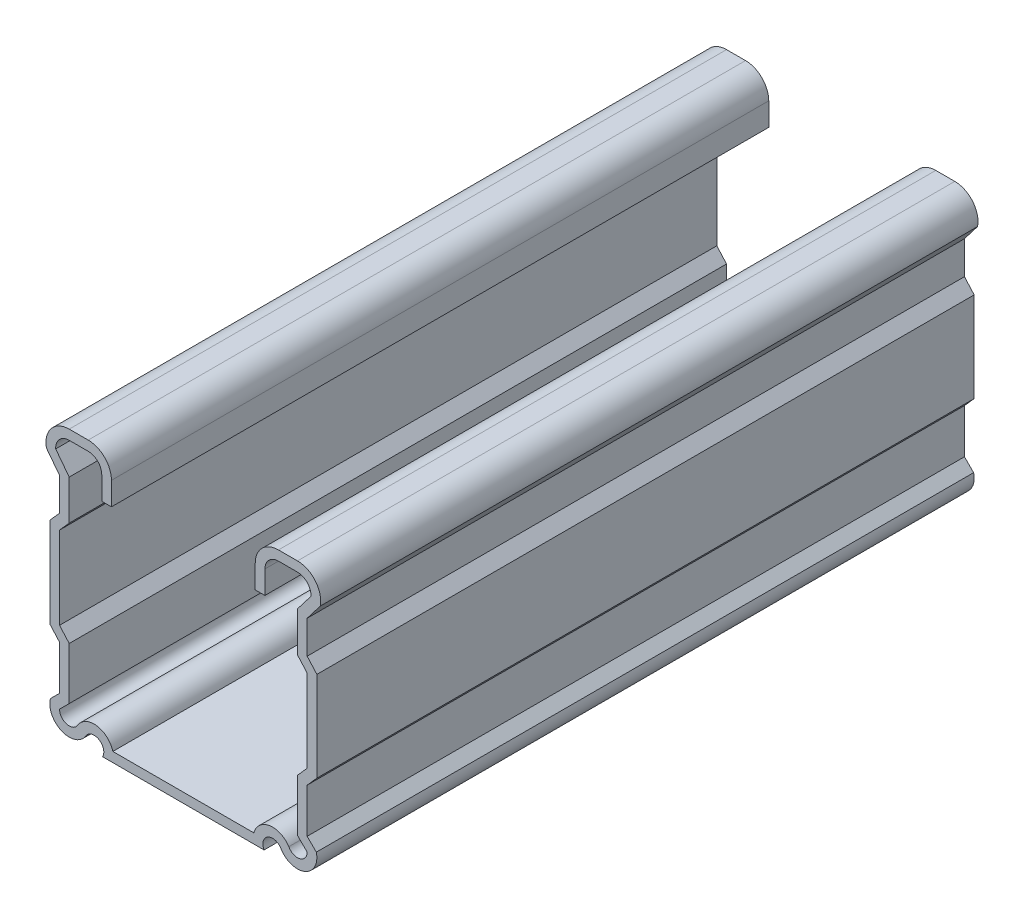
ISO-10303-21;
HEADER;
FILE_DESCRIPTION(('STEP AP214'),'2;1');
FILE_NAME('part.step','',(''),(''),'','','');
FILE_SCHEMA(('AUTOMOTIVE_DESIGN { 1 0 10303 214 1 1 1 1 }'));
ENDSEC;
DATA;
#1=APPLICATION_CONTEXT('core data for automotive mechanical design processes');
#2=APPLICATION_PROTOCOL_DEFINITION('international standard','automotive_design',2000,#1);
#3=PRODUCT_CONTEXT('',#1,'mechanical');
#4=PRODUCT('Part','Part','',(#3));
#5=PRODUCT_RELATED_PRODUCT_CATEGORY('part','',(#4));
#6=PRODUCT_DEFINITION_FORMATION('','',#4);
#7=PRODUCT_DEFINITION_CONTEXT('part definition',#1,'design');
#8=PRODUCT_DEFINITION('design','',#6,#7);
#9=PRODUCT_DEFINITION_SHAPE('','',#8);
#10=(LENGTH_UNIT() NAMED_UNIT(*) SI_UNIT(.MILLI.,.METRE.));
#11=(NAMED_UNIT(*) PLANE_ANGLE_UNIT() SI_UNIT($,.RADIAN.));
#12=(NAMED_UNIT(*) SI_UNIT($,.STERADIAN.) SOLID_ANGLE_UNIT());
#13=UNCERTAINTY_MEASURE_WITH_UNIT(LENGTH_MEASURE(1.E-05),#10,'distance_accuracy_value','');
#14=(GEOMETRIC_REPRESENTATION_CONTEXT(3) GLOBAL_UNCERTAINTY_ASSIGNED_CONTEXT((#13)) GLOBAL_UNIT_ASSIGNED_CONTEXT((#10,
#11,#12)) REPRESENTATION_CONTEXT('',''));
#15=CARTESIAN_POINT('',(0.,0.,0.));
#16=DIRECTION('',(0.,0.,1.));
#17=DIRECTION('',(1.,0.,0.));
#18=AXIS2_PLACEMENT_3D('',#15,#16,#17);
#19=CARTESIAN_POINT('',(13.7938113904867,-17.794678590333,101.6));
#20=DIRECTION('',(0.,0.,-1.));
#21=DIRECTION('',(-1.,0.,0.));
#22=AXIS2_PLACEMENT_3D('',#19,#20,#21);
#23=CYLINDRICAL_SURFACE('',#22,2.9972);
#24=CARTESIAN_POINT('',(13.7938113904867,-17.794678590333,0.));
#25=DIRECTION('',(0.,0.,1.));
#26=DIRECTION('',(1.,0.,0.));
#27=AXIS2_PLACEMENT_3D('',#24,#25,#26);
#28=CIRCLE('',#27,2.9972);
#29=CARTESIAN_POINT('',(16.3051886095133,-16.158771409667,0.));
#30=VERTEX_POINT('',#29);
#31=CARTESIAN_POINT('',(10.8989921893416,-17.018,0.));
#32=VERTEX_POINT('',#31);
#33=EDGE_CURVE('E416',#30,#32,#28,.T.);
#34=ORIENTED_EDGE('',*,*,#33,.T.);
#35=DIRECTION('',(0.,0.,-1.));
#36=VECTOR('',#35,1.);
#37=CARTESIAN_POINT('',(10.8989921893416,-17.018,101.6));
#38=LINE('',#37,#36);
#39=CARTESIAN_POINT('',(10.8989921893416,-17.018,101.6));
#40=VERTEX_POINT('',#39);
#41=EDGE_CURVE('E11',#40,#32,#38,.T.);
#42=ORIENTED_EDGE('',*,*,#41,.F.);
#43=CARTESIAN_POINT('',(13.7938113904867,-17.794678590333,101.6));
#44=DIRECTION('',(0.,0.,1.));
#45=DIRECTION('',(1.,0.,0.));
#46=AXIS2_PLACEMENT_3D('',#43,#44,#45);
#47=CIRCLE('',#46,2.9972);
#48=CARTESIAN_POINT('',(16.3051886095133,-16.158771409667,101.6));
#49=VERTEX_POINT('',#48);
#50=EDGE_CURVE('E527',#49,#40,#47,.T.);
#51=ORIENTED_EDGE('',*,*,#50,.F.);
#52=DIRECTION('',(0.,0.,-1.));
#53=VECTOR('',#52,1.);
#54=CARTESIAN_POINT('',(16.3051886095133,-16.158771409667,101.6));
#55=LINE('',#54,#53);
#56=EDGE_CURVE('E412',#49,#30,#55,.T.);
#57=ORIENTED_EDGE('',*,*,#56,.T.);
#58=EDGE_LOOP('',(#34,#42,#51,#57));
#59=FACE_BOUND('',#58,.T.);
#60=ADVANCED_FACE('F32',(#59),#23,.T.);
#61=CARTESIAN_POINT('',(-10.8989921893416,-17.018,101.6));
#62=DIRECTION('',(0.,-1.,0.));
#63=DIRECTION('',(1.,0.,0.));
#64=AXIS2_PLACEMENT_3D('',#61,#62,#63);
#65=PLANE('',#64);
#66=CARTESIAN_POINT('',(0.,-17.018,71.4375));
#67=DIRECTION('',(0.,-1.,0.));
#68=DIRECTION('',(1.,0.,0.));
#69=AXIS2_PLACEMENT_3D('',#66,#67,#68);
#70=CIRCLE('',#69,7.14375);
#71=CARTESIAN_POINT('',(7.14375,-17.018,71.4375));
#72=VERTEX_POINT('',#71);
#73=EDGE_CURVE('E1098',#72,#72,#70,.T.);
#74=ORIENTED_EDGE('',*,*,#73,.T.);
#75=EDGE_LOOP('',(#74));
#76=FACE_BOUND('',#75,.T.);
#77=CARTESIAN_POINT('',(0.,-17.018,23.8125));
#78=DIRECTION('',(0.,-1.,0.));
#79=DIRECTION('',(1.,0.,0.));
#80=AXIS2_PLACEMENT_3D('',#77,#78,#79);
#81=CIRCLE('',#80,7.14375);
#82=CARTESIAN_POINT('',(7.14375,-17.018,23.8125));
#83=VERTEX_POINT('',#82);
#84=EDGE_CURVE('E420',#83,#83,#81,.T.);
#85=ORIENTED_EDGE('',*,*,#84,.T.);
#86=EDGE_LOOP('',(#85));
#87=FACE_BOUND('',#86,.T.);
#88=DIRECTION('',(-1.,0.,0.));
#89=VECTOR('',#88,1.);
#90=CARTESIAN_POINT('',(-10.8989921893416,-17.018,0.));
#91=LINE('',#90,#89);
#92=CARTESIAN_POINT('',(-10.8989921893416,-17.018,0.));
#93=VERTEX_POINT('',#92);
#94=EDGE_CURVE('E419',#32,#93,#91,.T.);
#95=ORIENTED_EDGE('',*,*,#94,.T.);
#96=DIRECTION('',(0.,0.,-1.));
#97=VECTOR('',#96,1.);
#98=CARTESIAN_POINT('',(-10.8989921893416,-17.018,101.6));
#99=LINE('',#98,#97);
#100=CARTESIAN_POINT('',(-10.8989921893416,-17.018,101.6));
#101=VERTEX_POINT('',#100);
#102=EDGE_CURVE('E40',#101,#93,#99,.T.);
#103=ORIENTED_EDGE('',*,*,#102,.F.);
#104=DIRECTION('',(-1.,0.,0.));
#105=VECTOR('',#104,1.);
#106=CARTESIAN_POINT('',(-10.8989921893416,-17.018,101.6));
#107=LINE('',#106,#105);
#108=EDGE_CURVE('E235',#40,#101,#107,.T.);
#109=ORIENTED_EDGE('',*,*,#108,.F.);
#110=ORIENTED_EDGE('',*,*,#41,.T.);
#111=EDGE_LOOP('',(#95,#103,#109,#110));
#112=FACE_BOUND('',#111,.T.);
#113=ADVANCED_FACE('F825',(#76,#87,#112),#65,.F.);
#114=CARTESIAN_POINT('',(-13.7938113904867,-17.794678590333,101.6));
#115=DIRECTION('',(0.,0.,-1.));
#116=DIRECTION('',(-1.,0.,0.));
#117=AXIS2_PLACEMENT_3D('',#114,#115,#116);
#118=CYLINDRICAL_SURFACE('',#117,2.9972);
#119=CARTESIAN_POINT('',(-13.7938113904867,-17.794678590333,0.));
#120=DIRECTION('',(0.,0.,1.));
#121=DIRECTION('',(-1.,0.,0.));
#122=AXIS2_PLACEMENT_3D('',#119,#120,#121);
#123=CIRCLE('',#122,2.9972);
#124=CARTESIAN_POINT('',(-16.4142858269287,-16.3399203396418,0.));
#125=VERTEX_POINT('',#124);
#126=EDGE_CURVE('E422',#93,#125,#123,.T.);
#127=ORIENTED_EDGE('',*,*,#126,.T.);
#128=DIRECTION('',(0.,0.,-1.));
#129=VECTOR('',#128,1.);
#130=CARTESIAN_POINT('',(-16.4142858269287,-16.3399203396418,101.6));
#131=LINE('',#130,#129);
#132=CARTESIAN_POINT('',(-16.4142858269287,-16.3399203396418,101.6));
#133=VERTEX_POINT('',#132);
#134=EDGE_CURVE('E678',#133,#125,#131,.T.);
#135=ORIENTED_EDGE('',*,*,#134,.F.);
#136=CARTESIAN_POINT('',(-13.7938113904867,-17.794678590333,101.6));
#137=DIRECTION('',(0.,0.,1.));
#138=DIRECTION('',(-1.,0.,0.));
#139=AXIS2_PLACEMENT_3D('',#136,#137,#138);
#140=CIRCLE('',#139,2.9972);
#141=EDGE_CURVE('E686',#101,#133,#140,.T.);
#142=ORIENTED_EDGE('',*,*,#141,.F.);
#143=ORIENTED_EDGE('',*,*,#102,.T.);
#144=EDGE_LOOP('',(#127,#135,#142,#143));
#145=FACE_BOUND('',#144,.T.);
#146=ADVANCED_FACE('F684',(#145),#118,.T.);
#147=CARTESIAN_POINT('',(-17.6403,-15.478125,101.6));
#148=DIRECTION('',(0.,0.,-1.));
#149=DIRECTION('',(-1.,0.,0.));
#150=AXIS2_PLACEMENT_3D('',#147,#148,#149);
#151=CYLINDRICAL_SURFACE('',#150,1.4986);
#152=CARTESIAN_POINT('',(-17.6403,-15.478125,0.));
#153=DIRECTION('',(0.,0.,-1.));
#154=DIRECTION('',(1.,0.,0.));
#155=AXIS2_PLACEMENT_3D('',#152,#153,#154);
#156=CIRCLE('',#155,1.4986);
#157=CARTESIAN_POINT('',(-19.1389,-15.478125,0.));
#158=VERTEX_POINT('',#157);
#159=EDGE_CURVE('E424',#125,#158,#156,.T.);
#160=ORIENTED_EDGE('',*,*,#159,.T.);
#161=DIRECTION('',(0.,0.,-1.));
#162=VECTOR('',#161,1.);
#163=CARTESIAN_POINT('',(-19.1389,-15.478125,101.6));
#164=LINE('',#163,#162);
#165=CARTESIAN_POINT('',(-19.1389,-15.478125,101.6));
#166=VERTEX_POINT('',#165);
#167=EDGE_CURVE('E675',#166,#158,#164,.T.);
#168=ORIENTED_EDGE('',*,*,#167,.F.);
#169=CARTESIAN_POINT('',(-17.6403,-15.478125,101.6));
#170=DIRECTION('',(0.,0.,-1.));
#171=DIRECTION('',(1.,0.,0.));
#172=AXIS2_PLACEMENT_3D('',#169,#170,#171);
#173=CIRCLE('',#172,1.4986);
#174=EDGE_CURVE('E704',#133,#166,#173,.T.);
#175=ORIENTED_EDGE('',*,*,#174,.F.);
#176=ORIENTED_EDGE('',*,*,#134,.T.);
#177=EDGE_LOOP('',(#160,#168,#175,#176));
#178=FACE_BOUND('',#177,.T.);
#179=ADVANCED_FACE('F695',(#178),#151,.F.);
#180=CARTESIAN_POINT('',(-17.6403,-13.979525,101.6));
#181=DIRECTION('',(-0.707106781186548,0.707106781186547,0.));
#182=DIRECTION('',(-0.707106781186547,-0.707106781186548,0.));
#183=AXIS2_PLACEMENT_3D('',#180,#181,#182);
#184=PLANE('',#183);
#185=DIRECTION('',(0.707106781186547,0.707106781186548,0.));
#186=VECTOR('',#185,1.);
#187=CARTESIAN_POINT('',(-17.6403,-13.979525,0.));
#188=LINE('',#187,#186);
#189=CARTESIAN_POINT('',(-17.6403,-13.979525,0.));
#190=VERTEX_POINT('',#189);
#191=EDGE_CURVE('E426',#158,#190,#188,.T.);
#192=ORIENTED_EDGE('',*,*,#191,.T.);
#193=DIRECTION('',(0.,0.,-1.));
#194=VECTOR('',#193,1.);
#195=CARTESIAN_POINT('',(-17.6403,-13.979525,101.6));
#196=LINE('',#195,#194);
#197=CARTESIAN_POINT('',(-17.6403,-13.979525,101.6));
#198=VERTEX_POINT('',#197);
#199=EDGE_CURVE('E672',#198,#190,#196,.T.);
#200=ORIENTED_EDGE('',*,*,#199,.F.);
#201=DIRECTION('',(0.707106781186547,0.707106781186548,0.));
#202=VECTOR('',#201,1.);
#203=CARTESIAN_POINT('',(-17.6403,-13.979525,101.6));
#204=LINE('',#203,#202);
#205=EDGE_CURVE('E701',#166,#198,#204,.T.);
#206=ORIENTED_EDGE('',*,*,#205,.F.);
#207=ORIENTED_EDGE('',*,*,#167,.T.);
#208=EDGE_LOOP('',(#192,#200,#206,#207));
#209=FACE_BOUND('',#208,.T.);
#210=ADVANCED_FACE('F699',(#209),#184,.F.);
#211=CARTESIAN_POINT('',(-17.6403,-13.979525,101.6));
#212=DIRECTION('',(-1.,0.,0.));
#213=DIRECTION('',(0.,-1.,0.));
#214=AXIS2_PLACEMENT_3D('',#211,#212,#213);
#215=PLANE('',#214);
#216=DIRECTION('',(0.,1.,0.));
#217=VECTOR('',#216,1.);
#218=CARTESIAN_POINT('',(-17.6403,-13.979525,0.));
#219=LINE('',#218,#217);
#220=CARTESIAN_POINT('',(-17.6403,-5.93680201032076,0.));
#221=VERTEX_POINT('',#220);
#222=EDGE_CURVE('E428',#190,#221,#219,.T.);
#223=ORIENTED_EDGE('',*,*,#222,.T.);
#224=DIRECTION('',(0.,0.,-1.));
#225=VECTOR('',#224,1.);
#226=CARTESIAN_POINT('',(-17.6403,-5.93680201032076,101.6));
#227=LINE('',#226,#225);
#228=CARTESIAN_POINT('',(-17.6403,-5.93680201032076,101.6));
#229=VERTEX_POINT('',#228);
#230=EDGE_CURVE('E669',#229,#221,#227,.T.);
#231=ORIENTED_EDGE('',*,*,#230,.F.);
#232=DIRECTION('',(0.,1.,0.));
#233=VECTOR('',#232,1.);
#234=CARTESIAN_POINT('',(-17.6403,-13.979525,101.6));
#235=LINE('',#234,#233);
#236=EDGE_CURVE('E703',#198,#229,#235,.T.);
#237=ORIENTED_EDGE('',*,*,#236,.F.);
#238=ORIENTED_EDGE('',*,*,#199,.T.);
#239=EDGE_LOOP('',(#223,#231,#237,#238));
#240=FACE_BOUND('',#239,.T.);
#241=ADVANCED_FACE('F841',(#240),#215,.F.);
#242=CARTESIAN_POINT('',(-17.6403,-5.93680201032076,101.6));
#243=DIRECTION('',(-0.746819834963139,-0.665026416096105,0.));
#244=DIRECTION('',(0.665026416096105,-0.746819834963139,0.));
#245=AXIS2_PLACEMENT_3D('',#242,#243,#244);
#246=PLANE('',#245);
#247=DIRECTION('',(-0.665026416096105,0.746819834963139,0.));
#248=VECTOR('',#247,1.);
#249=CARTESIAN_POINT('',(-17.6403,-5.93680201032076,0.));
#250=LINE('',#249,#248);
#251=CARTESIAN_POINT('',(-19.1389,-4.25388509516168,0.));
#252=VERTEX_POINT('',#251);
#253=EDGE_CURVE('E430',#221,#252,#250,.T.);
#254=ORIENTED_EDGE('',*,*,#253,.T.);
#255=DIRECTION('',(0.,0.,-1.));
#256=VECTOR('',#255,1.);
#257=CARTESIAN_POINT('',(-19.1389,-4.25388509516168,101.6));
#258=LINE('',#257,#256);
#259=CARTESIAN_POINT('',(-19.1389,-4.25388509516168,101.6));
#260=VERTEX_POINT('',#259);
#261=EDGE_CURVE('E666',#260,#252,#258,.T.);
#262=ORIENTED_EDGE('',*,*,#261,.F.);
#263=DIRECTION('',(-0.665026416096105,0.746819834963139,0.));
#264=VECTOR('',#263,1.);
#265=CARTESIAN_POINT('',(-17.6403,-5.93680201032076,101.6));
#266=LINE('',#265,#264);
#267=EDGE_CURVE('E706',#229,#260,#266,.T.);
#268=ORIENTED_EDGE('',*,*,#267,.F.);
#269=ORIENTED_EDGE('',*,*,#230,.T.);
#270=EDGE_LOOP('',(#254,#262,#268,#269));
#271=FACE_BOUND('',#270,.T.);
#272=ADVANCED_FACE('F844',(#271),#246,.F.);
#273=CARTESIAN_POINT('',(-19.1389,-4.25388509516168,101.6));
#274=DIRECTION('',(-1.,0.,0.));
#275=DIRECTION('',(0.,0.,1.));
#276=AXIS2_PLACEMENT_3D('',#273,#274,#275);
#277=PLANE('',#276);
#278=DIRECTION('',(0.,1.,0.));
#279=VECTOR('',#278,1.);
#280=CARTESIAN_POINT('',(-19.1389,-4.25388509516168,0.));
#281=LINE('',#280,#279);
#282=CARTESIAN_POINT('',(-19.1389,8.49568509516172,0.));
#283=VERTEX_POINT('',#282);
#284=EDGE_CURVE('E432',#252,#283,#281,.T.);
#285=ORIENTED_EDGE('',*,*,#284,.T.);
#286=DIRECTION('',(0.,0.,-1.));
#287=VECTOR('',#286,1.);
#288=CARTESIAN_POINT('',(-19.1389,8.49568509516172,101.6));
#289=LINE('',#288,#287);
#290=CARTESIAN_POINT('',(-19.1389,8.49568509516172,101.6));
#291=VERTEX_POINT('',#290);
#292=EDGE_CURVE('E663',#291,#283,#289,.T.);
#293=ORIENTED_EDGE('',*,*,#292,.F.);
#294=DIRECTION('',(0.,1.,0.));
#295=VECTOR('',#294,1.);
#296=CARTESIAN_POINT('',(-19.1389,-4.25388509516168,101.6));
#297=LINE('',#296,#295);
#298=EDGE_CURVE('E712',#260,#291,#297,.T.);
#299=ORIENTED_EDGE('',*,*,#298,.F.);
#300=ORIENTED_EDGE('',*,*,#261,.T.);
#301=EDGE_LOOP('',(#285,#293,#299,#300));
#302=FACE_BOUND('',#301,.T.);
#303=ADVANCED_FACE('F848',(#302),#277,.F.);
#304=CARTESIAN_POINT('',(-17.6403,10.178602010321,101.6));
#305=DIRECTION('',(-0.746819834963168,0.665026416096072,0.));
#306=DIRECTION('',(-0.665026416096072,-0.746819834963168,0.));
#307=AXIS2_PLACEMENT_3D('',#304,#305,#306);
#308=PLANE('',#307);
#309=DIRECTION('',(0.665026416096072,0.746819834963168,0.));
#310=VECTOR('',#309,1.);
#311=CARTESIAN_POINT('',(-17.6403,10.178602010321,0.));
#312=LINE('',#311,#310);
#313=CARTESIAN_POINT('',(-17.6403,10.178602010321,0.));
#314=VERTEX_POINT('',#313);
#315=EDGE_CURVE('E434',#283,#314,#312,.T.);
#316=ORIENTED_EDGE('',*,*,#315,.T.);
#317=DIRECTION('',(0.,0.,-1.));
#318=VECTOR('',#317,1.);
#319=CARTESIAN_POINT('',(-17.6403,10.178602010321,101.6));
#320=LINE('',#319,#318);
#321=CARTESIAN_POINT('',(-17.6403,10.178602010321,101.6));
#322=VERTEX_POINT('',#321);
#323=EDGE_CURVE('E660',#322,#314,#320,.T.);
#324=ORIENTED_EDGE('',*,*,#323,.F.);
#325=DIRECTION('',(0.665026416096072,0.746819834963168,0.));
#326=VECTOR('',#325,1.);
#327=CARTESIAN_POINT('',(-17.6403,10.178602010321,101.6));
#328=LINE('',#327,#326);
#329=EDGE_CURVE('E714',#291,#322,#328,.T.);
#330=ORIENTED_EDGE('',*,*,#329,.F.);
#331=ORIENTED_EDGE('',*,*,#292,.T.);
#332=EDGE_LOOP('',(#316,#324,#330,#331));
#333=FACE_BOUND('',#332,.T.);
#334=ADVANCED_FACE('F852',(#333),#308,.F.);
#335=CARTESIAN_POINT('',(-17.6403,10.178602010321,101.6));
#336=DIRECTION('',(-1.,0.,0.));
#337=DIRECTION('',(0.,0.,1.));
#338=AXIS2_PLACEMENT_3D('',#335,#336,#337);
#339=PLANE('',#338);
#340=DIRECTION('',(0.,1.,0.));
#341=VECTOR('',#340,1.);
#342=CARTESIAN_POINT('',(-17.6403,10.178602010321,0.));
#343=LINE('',#342,#341);
#344=CARTESIAN_POINT('',(-17.6403,16.3392865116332,0.));
#345=VERTEX_POINT('',#344);
#346=EDGE_CURVE('E436',#314,#345,#343,.T.);
#347=ORIENTED_EDGE('',*,*,#346,.T.);
#348=DIRECTION('',(0.,0.,-1.));
#349=VECTOR('',#348,1.);
#350=CARTESIAN_POINT('',(-17.6403,16.3392865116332,101.6));
#351=LINE('',#350,#349);
#352=CARTESIAN_POINT('',(-17.6403,16.3392865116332,101.6));
#353=VERTEX_POINT('',#352);
#354=EDGE_CURVE('E657',#353,#345,#351,.T.);
#355=ORIENTED_EDGE('',*,*,#354,.F.);
#356=DIRECTION('',(0.,1.,0.));
#357=VECTOR('',#356,1.);
#358=CARTESIAN_POINT('',(-17.6403,10.178602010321,101.6));
#359=LINE('',#358,#357);
#360=EDGE_CURVE('E716',#322,#353,#359,.T.);
#361=ORIENTED_EDGE('',*,*,#360,.F.);
#362=ORIENTED_EDGE('',*,*,#323,.T.);
#363=EDGE_LOOP('',(#347,#355,#361,#362));
#364=FACE_BOUND('',#363,.T.);
#365=ADVANCED_FACE('F856',(#364),#339,.F.);
#366=CARTESIAN_POINT('',(-17.6403,16.3392865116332,101.6));
#367=DIRECTION('',(-0.793466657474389,-0.608613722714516,0.));
#368=DIRECTION('',(0.608613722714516,-0.793466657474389,0.));
#369=AXIS2_PLACEMENT_3D('',#366,#367,#368);
#370=PLANE('',#369);
#371=DIRECTION('',(-0.608613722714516,0.793466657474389,0.));
#372=VECTOR('',#371,1.);
#373=CARTESIAN_POINT('',(-17.6403,16.3392865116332,0.));
#374=LINE('',#373,#372);
#375=CARTESIAN_POINT('',(-19.7298825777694,19.0635335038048,0.));
#376=VERTEX_POINT('',#375);
#377=EDGE_CURVE('E438',#345,#376,#374,.T.);
#378=ORIENTED_EDGE('',*,*,#377,.T.);
#379=DIRECTION('',(0.,0.,-1.));
#380=VECTOR('',#379,1.);
#381=CARTESIAN_POINT('',(-19.7298825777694,19.0635335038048,101.6));
#382=LINE('',#381,#380);
#383=CARTESIAN_POINT('',(-19.7298825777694,19.0635335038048,101.6));
#384=VERTEX_POINT('',#383);
#385=EDGE_CURVE('E654',#384,#376,#382,.T.);
#386=ORIENTED_EDGE('',*,*,#385,.F.);
#387=DIRECTION('',(-0.608613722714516,0.793466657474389,0.));
#388=VECTOR('',#387,1.);
#389=CARTESIAN_POINT('',(-17.6403,16.3392865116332,101.6));
#390=LINE('',#389,#388);
#391=EDGE_CURVE('E718',#353,#384,#390,.T.);
#392=ORIENTED_EDGE('',*,*,#391,.F.);
#393=ORIENTED_EDGE('',*,*,#354,.T.);
#394=EDGE_LOOP('',(#378,#386,#392,#393));
#395=FACE_BOUND('',#394,.T.);
#396=ADVANCED_FACE('F860',(#395),#370,.F.);
#397=CARTESIAN_POINT('',(-17.6403,19.1676263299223,101.6));
#398=DIRECTION('',(0.,0.,-1.));
#399=DIRECTION('',(-1.,0.,0.));
#400=AXIS2_PLACEMENT_3D('',#397,#398,#399);
#401=CYLINDRICAL_SURFACE('',#400,2.09217367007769);
#402=CARTESIAN_POINT('',(-17.6403,19.1676263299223,0.));
#403=DIRECTION('',(0.,0.,-1.));
#404=DIRECTION('',(1.,0.,0.));
#405=AXIS2_PLACEMENT_3D('',#402,#403,#404);
#406=CIRCLE('',#405,2.09217367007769);
#407=CARTESIAN_POINT('',(-17.6403,21.2598,0.));
#408=VERTEX_POINT('',#407);
#409=EDGE_CURVE('E440',#376,#408,#406,.T.);
#410=ORIENTED_EDGE('',*,*,#409,.T.);
#411=DIRECTION('',(0.,0.,-1.));
#412=VECTOR('',#411,1.);
#413=CARTESIAN_POINT('',(-17.6403,21.2598,101.6));
#414=LINE('',#413,#412);
#415=CARTESIAN_POINT('',(-17.6403,21.2598,101.6));
#416=VERTEX_POINT('',#415);
#417=EDGE_CURVE('E651',#416,#408,#414,.T.);
#418=ORIENTED_EDGE('',*,*,#417,.F.);
#419=CARTESIAN_POINT('',(-17.6403,19.1676263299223,101.6));
#420=DIRECTION('',(0.,0.,-1.));
#421=DIRECTION('',(1.,0.,0.));
#422=AXIS2_PLACEMENT_3D('',#419,#420,#421);
#423=CIRCLE('',#422,2.09217367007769);
#424=EDGE_CURVE('E720',#384,#416,#423,.T.);
#425=ORIENTED_EDGE('',*,*,#424,.F.);
#426=ORIENTED_EDGE('',*,*,#385,.T.);
#427=EDGE_LOOP('',(#410,#418,#425,#426));
#428=FACE_BOUND('',#427,.T.);
#429=ADVANCED_FACE('F864',(#428),#401,.F.);
#430=CARTESIAN_POINT('',(-17.6403,21.2598,101.6));
#431=DIRECTION('',(0.,1.,0.));
#432=DIRECTION('',(0.,0.,1.));
#433=AXIS2_PLACEMENT_3D('',#430,#431,#432);
#434=PLANE('',#433);
#435=DIRECTION('',(1.,0.,0.));
#436=VECTOR('',#435,1.);
#437=CARTESIAN_POINT('',(-17.6403,21.2598,0.));
#438=LINE('',#437,#436);
#439=CARTESIAN_POINT('',(-14.7032736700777,21.2598,0.));
#440=VERTEX_POINT('',#439);
#441=EDGE_CURVE('E442',#408,#440,#438,.T.);
#442=ORIENTED_EDGE('',*,*,#441,.T.);
#443=DIRECTION('',(0.,0.,-1.));
#444=VECTOR('',#443,1.);
#445=CARTESIAN_POINT('',(-14.7032736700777,21.2598,101.6));
#446=LINE('',#445,#444);
#447=CARTESIAN_POINT('',(-14.7032736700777,21.2598,101.6));
#448=VERTEX_POINT('',#447);
#449=EDGE_CURVE('E648',#448,#440,#446,.T.);
#450=ORIENTED_EDGE('',*,*,#449,.F.);
#451=DIRECTION('',(1.,0.,0.));
#452=VECTOR('',#451,1.);
#453=CARTESIAN_POINT('',(-17.6403,21.2598,101.6));
#454=LINE('',#453,#452);
#455=EDGE_CURVE('E722',#416,#448,#454,.T.);
#456=ORIENTED_EDGE('',*,*,#455,.F.);
#457=ORIENTED_EDGE('',*,*,#417,.T.);
#458=EDGE_LOOP('',(#442,#450,#456,#457));
#459=FACE_BOUND('',#458,.T.);
#460=ADVANCED_FACE('F868',(#459),#434,.F.);
#461=CARTESIAN_POINT('',(-14.7032736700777,19.1676263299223,101.6));
#462=DIRECTION('',(0.,0.,-1.));
#463=DIRECTION('',(-1.,0.,0.));
#464=AXIS2_PLACEMENT_3D('',#461,#462,#463);
#465=CYLINDRICAL_SURFACE('',#464,2.09217367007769);
#466=CARTESIAN_POINT('',(-14.7032736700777,19.1676263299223,0.));
#467=DIRECTION('',(0.,0.,-1.));
#468=DIRECTION('',(1.,0.,0.));
#469=AXIS2_PLACEMENT_3D('',#466,#467,#468);
#470=CIRCLE('',#469,2.09217367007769);
#471=CARTESIAN_POINT('',(-12.6111,19.1676263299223,0.));
#472=VERTEX_POINT('',#471);
#473=EDGE_CURVE('E444',#440,#472,#470,.T.);
#474=ORIENTED_EDGE('',*,*,#473,.T.);
#475=DIRECTION('',(0.,0.,-1.));
#476=VECTOR('',#475,1.);
#477=CARTESIAN_POINT('',(-12.6111,19.1676263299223,101.6));
#478=LINE('',#477,#476);
#479=CARTESIAN_POINT('',(-12.6111,19.1676263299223,101.6));
#480=VERTEX_POINT('',#479);
#481=EDGE_CURVE('E645',#480,#472,#478,.T.);
#482=ORIENTED_EDGE('',*,*,#481,.F.);
#483=CARTESIAN_POINT('',(-14.7032736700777,19.1676263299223,101.6));
#484=DIRECTION('',(0.,0.,-1.));
#485=DIRECTION('',(1.,0.,0.));
#486=AXIS2_PLACEMENT_3D('',#483,#484,#485);
#487=CIRCLE('',#486,2.09217367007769);
#488=EDGE_CURVE('E724',#448,#480,#487,.T.);
#489=ORIENTED_EDGE('',*,*,#488,.F.);
#490=ORIENTED_EDGE('',*,*,#449,.T.);
#491=EDGE_LOOP('',(#474,#482,#489,#490));
#492=FACE_BOUND('',#491,.T.);
#493=ADVANCED_FACE('F872',(#492),#465,.F.);
#494=CARTESIAN_POINT('',(-12.6111,19.1676263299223,101.6));
#495=DIRECTION('',(1.,0.,0.));
#496=DIRECTION('',(0.,0.,-1.));
#497=AXIS2_PLACEMENT_3D('',#494,#495,#496);
#498=PLANE('',#497);
#499=DIRECTION('',(0.,-1.,0.));
#500=VECTOR('',#499,1.);
#501=CARTESIAN_POINT('',(-12.6111,19.1676263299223,0.));
#502=LINE('',#501,#500);
#503=CARTESIAN_POINT('',(-12.6111,15.61465,0.));
#504=VERTEX_POINT('',#503);
#505=EDGE_CURVE('E446',#472,#504,#502,.T.);
#506=ORIENTED_EDGE('',*,*,#505,.T.);
#507=DIRECTION('',(0.,0.,-1.));
#508=VECTOR('',#507,1.);
#509=CARTESIAN_POINT('',(-12.6111,15.61465,101.6));
#510=LINE('',#509,#508);
#511=CARTESIAN_POINT('',(-12.6111,15.61465,101.6));
#512=VERTEX_POINT('',#511);
#513=EDGE_CURVE('E642',#512,#504,#510,.T.);
#514=ORIENTED_EDGE('',*,*,#513,.F.);
#515=DIRECTION('',(0.,-1.,0.));
#516=VECTOR('',#515,1.);
#517=CARTESIAN_POINT('',(-12.6111,19.1676263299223,101.6));
#518=LINE('',#517,#516);
#519=EDGE_CURVE('E726',#480,#512,#518,.T.);
#520=ORIENTED_EDGE('',*,*,#519,.F.);
#521=ORIENTED_EDGE('',*,*,#481,.T.);
#522=EDGE_LOOP('',(#506,#514,#520,#521));
#523=FACE_BOUND('',#522,.T.);
#524=ADVANCED_FACE('F876',(#523),#498,.F.);
#525=CARTESIAN_POINT('',(-12.6111,15.61465,101.6));
#526=DIRECTION('',(0.,1.,0.));
#527=DIRECTION('',(0.,0.,1.));
#528=AXIS2_PLACEMENT_3D('',#525,#526,#527);
#529=PLANE('',#528);
#530=DIRECTION('',(1.,0.,0.));
#531=VECTOR('',#530,1.);
#532=CARTESIAN_POINT('',(-12.6111,15.61465,0.));
#533=LINE('',#532,#531);
#534=CARTESIAN_POINT('',(-11.1125,15.61465,0.));
#535=VERTEX_POINT('',#534);
#536=EDGE_CURVE('E448',#504,#535,#533,.T.);
#537=ORIENTED_EDGE('',*,*,#536,.T.);
#538=DIRECTION('',(0.,0.,-1.));
#539=VECTOR('',#538,1.);
#540=CARTESIAN_POINT('',(-11.1125,15.61465,101.6));
#541=LINE('',#540,#539);
#542=CARTESIAN_POINT('',(-11.1125,15.61465,101.6));
#543=VERTEX_POINT('',#542);
#544=EDGE_CURVE('E639',#543,#535,#541,.T.);
#545=ORIENTED_EDGE('',*,*,#544,.F.);
#546=DIRECTION('',(1.,0.,0.));
#547=VECTOR('',#546,1.);
#548=CARTESIAN_POINT('',(-12.6111,15.61465,101.6));
#549=LINE('',#548,#547);
#550=EDGE_CURVE('E728',#512,#543,#549,.T.);
#551=ORIENTED_EDGE('',*,*,#550,.F.);
#552=ORIENTED_EDGE('',*,*,#513,.T.);
#553=EDGE_LOOP('',(#537,#545,#551,#552));
#554=FACE_BOUND('',#553,.T.);
#555=ADVANCED_FACE('F880',(#554),#529,.F.);
#556=CARTESIAN_POINT('',(-11.1125,19.1676263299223,101.6));
#557=DIRECTION('',(-1.,0.,0.));
#558=DIRECTION('',(0.,0.,1.));
#559=AXIS2_PLACEMENT_3D('',#556,#557,#558);
#560=PLANE('',#559);
#561=DIRECTION('',(0.,1.,0.));
#562=VECTOR('',#561,1.);
#563=CARTESIAN_POINT('',(-11.1125,19.1676263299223,0.));
#564=LINE('',#563,#562);
#565=CARTESIAN_POINT('',(-11.1125,19.1676263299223,0.));
#566=VERTEX_POINT('',#565);
#567=EDGE_CURVE('E450',#535,#566,#564,.T.);
#568=ORIENTED_EDGE('',*,*,#567,.T.);
#569=DIRECTION('',(0.,0.,-1.));
#570=VECTOR('',#569,1.);
#571=CARTESIAN_POINT('',(-11.1125,19.1676263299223,101.6));
#572=LINE('',#571,#570);
#573=CARTESIAN_POINT('',(-11.1125,19.1676263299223,101.6));
#574=VERTEX_POINT('',#573);
#575=EDGE_CURVE('E636',#574,#566,#572,.T.);
#576=ORIENTED_EDGE('',*,*,#575,.F.);
#577=DIRECTION('',(0.,1.,0.));
#578=VECTOR('',#577,1.);
#579=CARTESIAN_POINT('',(-11.1125,19.1676263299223,101.6));
#580=LINE('',#579,#578);
#581=EDGE_CURVE('E730',#543,#574,#580,.T.);
#582=ORIENTED_EDGE('',*,*,#581,.F.);
#583=ORIENTED_EDGE('',*,*,#544,.T.);
#584=EDGE_LOOP('',(#568,#576,#582,#583));
#585=FACE_BOUND('',#584,.T.);
#586=ADVANCED_FACE('F884',(#585),#560,.F.);
#587=CARTESIAN_POINT('',(-14.7032736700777,19.1676263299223,101.6));
#588=DIRECTION('',(0.,0.,-1.));
#589=DIRECTION('',(-1.,0.,0.));
#590=AXIS2_PLACEMENT_3D('',#587,#588,#589);
#591=CYLINDRICAL_SURFACE('',#590,3.59077367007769);
#592=CARTESIAN_POINT('',(-14.7032736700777,19.1676263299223,0.));
#593=DIRECTION('',(0.,0.,1.));
#594=DIRECTION('',(1.,0.,0.));
#595=AXIS2_PLACEMENT_3D('',#592,#593,#594);
#596=CIRCLE('',#595,3.59077367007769);
#597=CARTESIAN_POINT('',(-14.7032736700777,22.7584,0.));
#598=VERTEX_POINT('',#597);
#599=EDGE_CURVE('E452',#566,#598,#596,.T.);
#600=ORIENTED_EDGE('',*,*,#599,.T.);
#601=DIRECTION('',(0.,0.,-1.));
#602=VECTOR('',#601,1.);
#603=CARTESIAN_POINT('',(-14.7032736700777,22.7584,101.6));
#604=LINE('',#603,#602);
#605=CARTESIAN_POINT('',(-14.7032736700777,22.7584,101.6));
#606=VERTEX_POINT('',#605);
#607=EDGE_CURVE('E633',#606,#598,#604,.T.);
#608=ORIENTED_EDGE('',*,*,#607,.F.);
#609=CARTESIAN_POINT('',(-14.7032736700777,19.1676263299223,101.6));
#610=DIRECTION('',(0.,0.,1.));
#611=DIRECTION('',(1.,0.,0.));
#612=AXIS2_PLACEMENT_3D('',#609,#610,#611);
#613=CIRCLE('',#612,3.59077367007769);
#614=EDGE_CURVE('E732',#574,#606,#613,.T.);
#615=ORIENTED_EDGE('',*,*,#614,.F.);
#616=ORIENTED_EDGE('',*,*,#575,.T.);
#617=EDGE_LOOP('',(#600,#608,#615,#616));
#618=FACE_BOUND('',#617,.T.);
#619=ADVANCED_FACE('F888',(#618),#591,.T.);
#620=CARTESIAN_POINT('',(-17.6403,22.7584,101.6));
#621=DIRECTION('',(0.,-1.,0.));
#622=DIRECTION('',(1.,0.,0.));
#623=AXIS2_PLACEMENT_3D('',#620,#621,#622);
#624=PLANE('',#623);
#625=DIRECTION('',(-1.,0.,0.));
#626=VECTOR('',#625,1.);
#627=CARTESIAN_POINT('',(-17.6403,22.7584,0.));
#628=LINE('',#627,#626);
#629=CARTESIAN_POINT('',(-17.6403,22.7584,0.));
#630=VERTEX_POINT('',#629);
#631=EDGE_CURVE('E454',#598,#630,#628,.T.);
#632=ORIENTED_EDGE('',*,*,#631,.T.);
#633=DIRECTION('',(0.,0.,-1.));
#634=VECTOR('',#633,1.);
#635=CARTESIAN_POINT('',(-17.6403,22.7584,101.6));
#636=LINE('',#635,#634);
#637=CARTESIAN_POINT('',(-17.6403,22.7584,101.6));
#638=VERTEX_POINT('',#637);
#639=EDGE_CURVE('E630',#638,#630,#636,.T.);
#640=ORIENTED_EDGE('',*,*,#639,.F.);
#641=DIRECTION('',(-1.,0.,0.));
#642=VECTOR('',#641,1.);
#643=CARTESIAN_POINT('',(-17.6403,22.7584,101.6));
#644=LINE('',#643,#642);
#645=EDGE_CURVE('E734',#606,#638,#644,.T.);
#646=ORIENTED_EDGE('',*,*,#645,.F.);
#647=ORIENTED_EDGE('',*,*,#607,.T.);
#648=EDGE_LOOP('',(#632,#640,#646,#647));
#649=FACE_BOUND('',#648,.T.);
#650=ADVANCED_FACE('F892',(#649),#624,.F.);
#651=CARTESIAN_POINT('',(-17.6403,19.1676263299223,101.6));
#652=DIRECTION('',(0.,0.,-1.));
#653=DIRECTION('',(-1.,0.,0.));
#654=AXIS2_PLACEMENT_3D('',#651,#652,#653);
#655=CYLINDRICAL_SURFACE('',#654,3.59077367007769);
#656=CARTESIAN_POINT('',(-17.6403,19.1676263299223,0.));
#657=DIRECTION('',(0.,0.,1.));
#658=DIRECTION('',(1.,0.,0.));
#659=AXIS2_PLACEMENT_3D('',#656,#657,#658);
#660=CIRCLE('',#659,3.59077367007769);
#661=CARTESIAN_POINT('',(-21.1624286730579,18.4688666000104,0.));
#662=VERTEX_POINT('',#661);
#663=EDGE_CURVE('E456',#630,#662,#660,.T.);
#664=ORIENTED_EDGE('',*,*,#663,.T.);
#665=DIRECTION('',(0.,0.,-1.));
#666=VECTOR('',#665,1.);
#667=CARTESIAN_POINT('',(-21.1624286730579,18.4688666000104,101.6));
#668=LINE('',#667,#666);
#669=CARTESIAN_POINT('',(-21.1624286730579,18.4688666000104,101.6));
#670=VERTEX_POINT('',#669);
#671=EDGE_CURVE('E627',#670,#662,#668,.T.);
#672=ORIENTED_EDGE('',*,*,#671,.F.);
#673=CARTESIAN_POINT('',(-17.6403,19.1676263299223,101.6));
#674=DIRECTION('',(0.,0.,1.));
#675=DIRECTION('',(1.,0.,0.));
#676=AXIS2_PLACEMENT_3D('',#673,#674,#675);
#677=CIRCLE('',#676,3.59077367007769);
#678=EDGE_CURVE('E736',#638,#670,#677,.T.);
#679=ORIENTED_EDGE('',*,*,#678,.F.);
#680=ORIENTED_EDGE('',*,*,#639,.T.);
#681=EDGE_LOOP('',(#664,#672,#679,#680));
#682=FACE_BOUND('',#681,.T.);
#683=ADVANCED_FACE('F896',(#682),#655,.T.);
#684=CARTESIAN_POINT('',(-19.1389,15.8307359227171,101.6));
#685=DIRECTION('',(0.793466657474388,0.608613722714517,0.));
#686=DIRECTION('',(-0.608613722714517,0.793466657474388,0.));
#687=AXIS2_PLACEMENT_3D('',#684,#685,#686);
#688=PLANE('',#687);
#689=DIRECTION('',(0.608613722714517,-0.793466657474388,0.));
#690=VECTOR('',#689,1.);
#691=CARTESIAN_POINT('',(-19.1389,15.8307359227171,0.));
#692=LINE('',#691,#690);
#693=CARTESIAN_POINT('',(-19.1389,15.8307359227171,0.));
#694=VERTEX_POINT('',#693);
#695=EDGE_CURVE('E458',#662,#694,#692,.T.);
#696=ORIENTED_EDGE('',*,*,#695,.T.);
#697=DIRECTION('',(0.,0.,-1.));
#698=VECTOR('',#697,1.);
#699=CARTESIAN_POINT('',(-19.1389,15.8307359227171,101.6));
#700=LINE('',#699,#698);
#701=CARTESIAN_POINT('',(-19.1389,15.8307359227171,101.6));
#702=VERTEX_POINT('',#701);
#703=EDGE_CURVE('E624',#702,#694,#700,.T.);
#704=ORIENTED_EDGE('',*,*,#703,.F.);
#705=DIRECTION('',(0.608613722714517,-0.793466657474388,0.));
#706=VECTOR('',#705,1.);
#707=CARTESIAN_POINT('',(-19.1389,15.8307359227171,101.6));
#708=LINE('',#707,#706);
#709=EDGE_CURVE('E738',#670,#702,#708,.T.);
#710=ORIENTED_EDGE('',*,*,#709,.F.);
#711=ORIENTED_EDGE('',*,*,#671,.T.);
#712=EDGE_LOOP('',(#696,#704,#710,#711));
#713=FACE_BOUND('',#712,.T.);
#714=ADVANCED_FACE('F900',(#713),#688,.F.);
#715=CARTESIAN_POINT('',(-19.1389,10.7491294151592,101.6));
#716=DIRECTION('',(1.,0.,0.));
#717=DIRECTION('',(0.,0.,-1.));
#718=AXIS2_PLACEMENT_3D('',#715,#716,#717);
#719=PLANE('',#718);
#720=DIRECTION('',(0.,-1.,0.));
#721=VECTOR('',#720,1.);
#722=CARTESIAN_POINT('',(-19.1389,10.7491294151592,0.));
#723=LINE('',#722,#721);
#724=CARTESIAN_POINT('',(-19.1389,10.7491294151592,0.));
#725=VERTEX_POINT('',#724);
#726=EDGE_CURVE('E460',#694,#725,#723,.T.);
#727=ORIENTED_EDGE('',*,*,#726,.T.);
#728=DIRECTION('',(0.,0.,-1.));
#729=VECTOR('',#728,1.);
#730=CARTESIAN_POINT('',(-19.1389,10.7491294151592,101.6));
#731=LINE('',#730,#729);
#732=CARTESIAN_POINT('',(-19.1389,10.7491294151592,101.6));
#733=VERTEX_POINT('',#732);
#734=EDGE_CURVE('E621',#733,#725,#731,.T.);
#735=ORIENTED_EDGE('',*,*,#734,.F.);
#736=DIRECTION('',(0.,-1.,0.));
#737=VECTOR('',#736,1.);
#738=CARTESIAN_POINT('',(-19.1389,10.7491294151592,101.6));
#739=LINE('',#738,#737);
#740=EDGE_CURVE('E740',#702,#733,#739,.T.);
#741=ORIENTED_EDGE('',*,*,#740,.F.);
#742=ORIENTED_EDGE('',*,*,#703,.T.);
#743=EDGE_LOOP('',(#727,#735,#741,#742));
#744=FACE_BOUND('',#743,.T.);
#745=ADVANCED_FACE('F904',(#744),#719,.F.);
#746=CARTESIAN_POINT('',(-19.1389,10.7491294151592,101.6));
#747=DIRECTION('',(0.746819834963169,-0.665026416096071,0.));
#748=DIRECTION('',(0.665026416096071,0.746819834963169,0.));
#749=AXIS2_PLACEMENT_3D('',#746,#747,#748);
#750=PLANE('',#749);
#751=DIRECTION('',(-0.665026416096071,-0.746819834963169,0.));
#752=VECTOR('',#751,1.);
#753=CARTESIAN_POINT('',(-19.1389,10.7491294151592,0.));
#754=LINE('',#753,#752);
#755=CARTESIAN_POINT('',(-20.6375,9.0662125,0.));
#756=VERTEX_POINT('',#755);
#757=EDGE_CURVE('E462',#725,#756,#754,.T.);
#758=ORIENTED_EDGE('',*,*,#757,.T.);
#759=DIRECTION('',(0.,0.,-1.));
#760=VECTOR('',#759,1.);
#761=CARTESIAN_POINT('',(-20.6375,9.0662125,101.6));
#762=LINE('',#761,#760);
#763=CARTESIAN_POINT('',(-20.6375,9.0662125,101.6));
#764=VERTEX_POINT('',#763);
#765=EDGE_CURVE('E618',#764,#756,#762,.T.);
#766=ORIENTED_EDGE('',*,*,#765,.F.);
#767=DIRECTION('',(-0.665026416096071,-0.746819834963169,0.));
#768=VECTOR('',#767,1.);
#769=CARTESIAN_POINT('',(-19.1389,10.7491294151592,101.6));
#770=LINE('',#769,#768);
#771=EDGE_CURVE('E742',#733,#764,#770,.T.);
#772=ORIENTED_EDGE('',*,*,#771,.F.);
#773=ORIENTED_EDGE('',*,*,#734,.T.);
#774=EDGE_LOOP('',(#758,#766,#772,#773));
#775=FACE_BOUND('',#774,.T.);
#776=ADVANCED_FACE('F908',(#775),#750,.F.);
#777=CARTESIAN_POINT('',(-20.6375,-4.8244125,101.6));
#778=DIRECTION('',(1.,0.,0.));
#779=DIRECTION('',(0.,1.,0.));
#780=AXIS2_PLACEMENT_3D('',#777,#778,#779);
#781=PLANE('',#780);
#782=DIRECTION('',(0.,-1.,0.));
#783=VECTOR('',#782,1.);
#784=CARTESIAN_POINT('',(-20.6375,-4.8244125,0.));
#785=LINE('',#784,#783);
#786=CARTESIAN_POINT('',(-20.6375,-4.8244125,0.));
#787=VERTEX_POINT('',#786);
#788=EDGE_CURVE('E464',#756,#787,#785,.T.);
#789=ORIENTED_EDGE('',*,*,#788,.T.);
#790=DIRECTION('',(0.,0.,-1.));
#791=VECTOR('',#790,1.);
#792=CARTESIAN_POINT('',(-20.6375,-4.8244125,101.6));
#793=LINE('',#792,#791);
#794=CARTESIAN_POINT('',(-20.6375,-4.8244125,101.6));
#795=VERTEX_POINT('',#794);
#796=EDGE_CURVE('E615',#795,#787,#793,.T.);
#797=ORIENTED_EDGE('',*,*,#796,.F.);
#798=DIRECTION('',(0.,-1.,0.));
#799=VECTOR('',#798,1.);
#800=CARTESIAN_POINT('',(-20.6375,-4.8244125,101.6));
#801=LINE('',#800,#799);
#802=EDGE_CURVE('E744',#764,#795,#801,.T.);
#803=ORIENTED_EDGE('',*,*,#802,.F.);
#804=ORIENTED_EDGE('',*,*,#765,.T.);
#805=EDGE_LOOP('',(#789,#797,#803,#804));
#806=FACE_BOUND('',#805,.T.);
#807=ADVANCED_FACE('F912',(#806),#781,.F.);
#808=CARTESIAN_POINT('',(-19.1389,-6.50732941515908,101.6));
#809=DIRECTION('',(0.746819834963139,0.665026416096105,0.));
#810=DIRECTION('',(-0.665026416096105,0.746819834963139,0.));
#811=AXIS2_PLACEMENT_3D('',#808,#809,#810);
#812=PLANE('',#811);
#813=DIRECTION('',(0.665026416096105,-0.746819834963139,0.));
#814=VECTOR('',#813,1.);
#815=CARTESIAN_POINT('',(-19.1389,-6.50732941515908,0.));
#816=LINE('',#815,#814);
#817=CARTESIAN_POINT('',(-19.1389,-6.50732941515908,0.));
#818=VERTEX_POINT('',#817);
#819=EDGE_CURVE('E466',#787,#818,#816,.T.);
#820=ORIENTED_EDGE('',*,*,#819,.T.);
#821=DIRECTION('',(0.,0.,-1.));
#822=VECTOR('',#821,1.);
#823=CARTESIAN_POINT('',(-19.1389,-6.50732941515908,101.6));
#824=LINE('',#823,#822);
#825=CARTESIAN_POINT('',(-19.1389,-6.50732941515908,101.6));
#826=VERTEX_POINT('',#825);
#827=EDGE_CURVE('E612',#826,#818,#824,.T.);
#828=ORIENTED_EDGE('',*,*,#827,.F.);
#829=DIRECTION('',(0.665026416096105,-0.746819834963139,0.));
#830=VECTOR('',#829,1.);
#831=CARTESIAN_POINT('',(-19.1389,-6.50732941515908,101.6));
#832=LINE('',#831,#830);
#833=EDGE_CURVE('E746',#795,#826,#832,.T.);
#834=ORIENTED_EDGE('',*,*,#833,.F.);
#835=ORIENTED_EDGE('',*,*,#796,.T.);
#836=EDGE_LOOP('',(#820,#828,#834,#835));
#837=FACE_BOUND('',#836,.T.);
#838=ADVANCED_FACE('F916',(#837),#812,.F.);
#839=CARTESIAN_POINT('',(-19.1389,-13.3587845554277,101.6));
#840=DIRECTION('',(1.,0.,0.));
#841=DIRECTION('',(0.,0.,-1.));
#842=AXIS2_PLACEMENT_3D('',#839,#840,#841);
#843=PLANE('',#842);
#844=DIRECTION('',(0.,-1.,0.));
#845=VECTOR('',#844,1.);
#846=CARTESIAN_POINT('',(-19.1389,-13.3587845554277,0.));
#847=LINE('',#846,#845);
#848=CARTESIAN_POINT('',(-19.1389,-13.3587845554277,0.));
#849=VERTEX_POINT('',#848);
#850=EDGE_CURVE('E468',#818,#849,#847,.T.);
#851=ORIENTED_EDGE('',*,*,#850,.T.);
#852=DIRECTION('',(0.,0.,-1.));
#853=VECTOR('',#852,1.);
#854=CARTESIAN_POINT('',(-19.1389,-13.3587845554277,101.6));
#855=LINE('',#854,#853);
#856=CARTESIAN_POINT('',(-19.1389,-13.3587845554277,101.6));
#857=VERTEX_POINT('',#856);
#858=EDGE_CURVE('E609',#857,#849,#855,.T.);
#859=ORIENTED_EDGE('',*,*,#858,.F.);
#860=DIRECTION('',(0.,-1.,0.));
#861=VECTOR('',#860,1.);
#862=CARTESIAN_POINT('',(-19.1389,-13.3587845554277,101.6));
#863=LINE('',#862,#861);
#864=EDGE_CURVE('E748',#826,#857,#863,.T.);
#865=ORIENTED_EDGE('',*,*,#864,.F.);
#866=ORIENTED_EDGE('',*,*,#827,.T.);
#867=EDGE_LOOP('',(#851,#859,#865,#866));
#868=FACE_BOUND('',#867,.T.);
#869=ADVANCED_FACE('F920',(#868),#843,.F.);
#870=CARTESIAN_POINT('',(-19.1389,-13.3587845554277,101.6));
#871=DIRECTION('',(0.707106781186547,-0.707106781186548,0.));
#872=DIRECTION('',(0.707106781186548,0.707106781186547,0.));
#873=AXIS2_PLACEMENT_3D('',#870,#871,#872);
#874=PLANE('',#873);
#875=DIRECTION('',(-0.707106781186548,-0.707106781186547,0.));
#876=VECTOR('',#875,1.);
#877=CARTESIAN_POINT('',(-19.1389,-13.3587845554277,0.));
#878=LINE('',#877,#876);
#879=CARTESIAN_POINT('',(-20.5534580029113,-14.773342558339,0.));
#880=VERTEX_POINT('',#879);
#881=EDGE_CURVE('E470',#849,#880,#878,.T.);
#882=ORIENTED_EDGE('',*,*,#881,.T.);
#883=DIRECTION('',(0.,0.,-1.));
#884=VECTOR('',#883,1.);
#885=CARTESIAN_POINT('',(-20.5534580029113,-14.773342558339,101.6));
#886=LINE('',#885,#884);
#887=CARTESIAN_POINT('',(-20.5534580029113,-14.773342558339,101.6));
#888=VERTEX_POINT('',#887);
#889=EDGE_CURVE('E606',#888,#880,#886,.T.);
#890=ORIENTED_EDGE('',*,*,#889,.F.);
#891=DIRECTION('',(-0.707106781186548,-0.707106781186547,0.));
#892=VECTOR('',#891,1.);
#893=CARTESIAN_POINT('',(-19.1389,-13.3587845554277,101.6));
#894=LINE('',#893,#892);
#895=EDGE_CURVE('E750',#857,#888,#894,.T.);
#896=ORIENTED_EDGE('',*,*,#895,.F.);
#897=ORIENTED_EDGE('',*,*,#858,.T.);
#898=EDGE_LOOP('',(#882,#890,#896,#897));
#899=FACE_BOUND('',#898,.T.);
#900=ADVANCED_FACE('F924',(#899),#874,.F.);
#901=CARTESIAN_POINT('',(-17.6403,-15.478125,101.6));
#902=DIRECTION('',(0.,0.,-1.));
#903=DIRECTION('',(-1.,0.,0.));
#904=AXIS2_PLACEMENT_3D('',#901,#902,#903);
#905=CYLINDRICAL_SURFACE('',#904,2.9972);
#906=CARTESIAN_POINT('',(-17.6403,-15.478125,0.));
#907=DIRECTION('',(0.,0.,1.));
#908=DIRECTION('',(1.,0.,0.));
#909=AXIS2_PLACEMENT_3D('',#906,#907,#908);
#910=CIRCLE('',#909,2.9972);
#911=CARTESIAN_POINT('',(-15.019825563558,-16.9328832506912,0.));
#912=VERTEX_POINT('',#911);
#913=EDGE_CURVE('E472',#880,#912,#910,.T.);
#914=ORIENTED_EDGE('',*,*,#913,.T.);
#915=DIRECTION('',(0.,0.,-1.));
#916=VECTOR('',#915,1.);
#917=CARTESIAN_POINT('',(-15.019825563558,-16.9328832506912,101.6));
#918=LINE('',#917,#916);
#919=CARTESIAN_POINT('',(-15.019825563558,-16.9328832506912,101.6));
#920=VERTEX_POINT('',#919);
#921=EDGE_CURVE('E603',#920,#912,#918,.T.);
#922=ORIENTED_EDGE('',*,*,#921,.F.);
#923=CARTESIAN_POINT('',(-17.6403,-15.478125,101.6));
#924=DIRECTION('',(0.,0.,1.));
#925=DIRECTION('',(1.,0.,0.));
#926=AXIS2_PLACEMENT_3D('',#923,#924,#925);
#927=CIRCLE('',#926,2.9972);
#928=EDGE_CURVE('E752',#888,#920,#927,.T.);
#929=ORIENTED_EDGE('',*,*,#928,.F.);
#930=ORIENTED_EDGE('',*,*,#889,.T.);
#931=EDGE_LOOP('',(#914,#922,#929,#930));
#932=FACE_BOUND('',#931,.T.);
#933=ADVANCED_FACE('F928',(#932),#905,.T.);
#934=CARTESIAN_POINT('',(-13.7938113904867,-17.794678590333,101.6));
#935=DIRECTION('',(0.,0.,-1.));
#936=DIRECTION('',(-1.,0.,0.));
#937=AXIS2_PLACEMENT_3D('',#934,#935,#936);
#938=CYLINDRICAL_SURFACE('',#937,1.4986);
#939=CARTESIAN_POINT('',(-13.7938113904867,-17.794678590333,0.));
#940=DIRECTION('',(0.,0.,-1.));
#941=DIRECTION('',(-1.,0.,0.));
#942=AXIS2_PLACEMENT_3D('',#939,#940,#941);
#943=CIRCLE('',#942,1.4986);
#944=CARTESIAN_POINT('',(-12.4805591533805,-18.5166,0.));
#945=VERTEX_POINT('',#944);
#946=EDGE_CURVE('E474',#912,#945,#943,.T.);
#947=ORIENTED_EDGE('',*,*,#946,.T.);
#948=DIRECTION('',(0.,0.,-1.));
#949=VECTOR('',#948,1.);
#950=CARTESIAN_POINT('',(-12.4805591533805,-18.5166,101.6));
#951=LINE('',#950,#949);
#952=CARTESIAN_POINT('',(-12.4805591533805,-18.5166,101.6));
#953=VERTEX_POINT('',#952);
#954=EDGE_CURVE('E600',#953,#945,#951,.T.);
#955=ORIENTED_EDGE('',*,*,#954,.F.);
#956=CARTESIAN_POINT('',(-13.7938113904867,-17.794678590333,101.6));
#957=DIRECTION('',(0.,0.,-1.));
#958=DIRECTION('',(-1.,0.,0.));
#959=AXIS2_PLACEMENT_3D('',#956,#957,#958);
#960=CIRCLE('',#959,1.4986);
#961=EDGE_CURVE('E754',#920,#953,#960,.T.);
#962=ORIENTED_EDGE('',*,*,#961,.F.);
#963=ORIENTED_EDGE('',*,*,#921,.T.);
#964=EDGE_LOOP('',(#947,#955,#962,#963));
#965=FACE_BOUND('',#964,.T.);
#966=ADVANCED_FACE('F932',(#965),#938,.F.);
#967=CARTESIAN_POINT('',(-12.4805591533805,-18.5166,101.6));
#968=DIRECTION('',(0.,1.,0.));
#969=DIRECTION('',(0.,0.,1.));
#970=AXIS2_PLACEMENT_3D('',#967,#968,#969);
#971=PLANE('',#970);
#972=CARTESIAN_POINT('',(0.,-18.5166,71.4375));
#973=DIRECTION('',(0.,-1.,0.));
#974=DIRECTION('',(0.,0.,-1.));
#975=AXIS2_PLACEMENT_3D('',#972,#973,#974);
#976=CIRCLE('',#975,7.14375);
#977=CARTESIAN_POINT('',(0.,-18.5166,64.29375));
#978=VERTEX_POINT('',#977);
#979=EDGE_CURVE('E1096',#978,#978,#976,.T.);
#980=ORIENTED_EDGE('',*,*,#979,.F.);
#981=EDGE_LOOP('',(#980));
#982=FACE_BOUND('',#981,.T.);
#983=CARTESIAN_POINT('',(0.,-18.5166,23.8125));
#984=DIRECTION('',(0.,-1.,0.));
#985=DIRECTION('',(0.,0.,-1.));
#986=AXIS2_PLACEMENT_3D('',#983,#984,#985);
#987=CIRCLE('',#986,7.14375);
#988=CARTESIAN_POINT('',(0.,-18.5166,16.66875));
#989=VERTEX_POINT('',#988);
#990=EDGE_CURVE('E1099',#989,#989,#987,.T.);
#991=ORIENTED_EDGE('',*,*,#990,.F.);
#992=EDGE_LOOP('',(#991));
#993=FACE_BOUND('',#992,.T.);
#994=DIRECTION('',(1.,0.,0.));
#995=VECTOR('',#994,1.);
#996=CARTESIAN_POINT('',(-12.4805591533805,-18.5166,0.));
#997=LINE('',#996,#995);
#998=CARTESIAN_POINT('',(12.4805591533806,-18.5166,0.));
#999=VERTEX_POINT('',#998);
#1000=EDGE_CURVE('E476',#945,#999,#997,.T.);
#1001=ORIENTED_EDGE('',*,*,#1000,.T.);
#1002=DIRECTION('',(0.,0.,-1.));
#1003=VECTOR('',#1002,1.);
#1004=CARTESIAN_POINT('',(12.4805591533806,-18.5166,101.6));
#1005=LINE('',#1004,#1003);
#1006=CARTESIAN_POINT('',(12.4805591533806,-18.5166,101.6));
#1007=VERTEX_POINT('',#1006);
#1008=EDGE_CURVE('E597',#1007,#999,#1005,.T.);
#1009=ORIENTED_EDGE('',*,*,#1008,.F.);
#1010=DIRECTION('',(1.,0.,0.));
#1011=VECTOR('',#1010,1.);
#1012=CARTESIAN_POINT('',(-12.4805591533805,-18.5166,101.6));
#1013=LINE('',#1012,#1011);
#1014=EDGE_CURVE('E756',#953,#1007,#1013,.T.);
#1015=ORIENTED_EDGE('',*,*,#1014,.F.);
#1016=ORIENTED_EDGE('',*,*,#954,.T.);
#1017=EDGE_LOOP('',(#1001,#1009,#1015,#1016));
#1018=FACE_BOUND('',#1017,.T.);
#1019=ADVANCED_FACE('F936',(#982,#993,#1018),#971,.F.);
#1020=CARTESIAN_POINT('',(13.7938113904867,-17.794678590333,101.6));
#1021=DIRECTION('',(0.,0.,-1.));
#1022=DIRECTION('',(-1.,0.,0.));
#1023=AXIS2_PLACEMENT_3D('',#1020,#1021,#1022);
#1024=CYLINDRICAL_SURFACE('',#1023,1.4986);
#1025=CARTESIAN_POINT('',(13.7938113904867,-17.794678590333,0.));
#1026=DIRECTION('',(0.,0.,-1.));
#1027=DIRECTION('',(1.,0.,0.));
#1028=AXIS2_PLACEMENT_3D('',#1025,#1026,#1027);
#1029=CIRCLE('',#1028,1.4986);
#1030=CARTESIAN_POINT('',(15.0198255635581,-16.9328832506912,0.));
#1031=VERTEX_POINT('',#1030);
#1032=EDGE_CURVE('E478',#999,#1031,#1029,.T.);
#1033=ORIENTED_EDGE('',*,*,#1032,.T.);
#1034=DIRECTION('',(0.,0.,-1.));
#1035=VECTOR('',#1034,1.);
#1036=CARTESIAN_POINT('',(15.0198255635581,-16.9328832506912,101.6));
#1037=LINE('',#1036,#1035);
#1038=CARTESIAN_POINT('',(15.0198255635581,-16.9328832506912,101.6));
#1039=VERTEX_POINT('',#1038);
#1040=EDGE_CURVE('E594',#1039,#1031,#1037,.T.);
#1041=ORIENTED_EDGE('',*,*,#1040,.F.);
#1042=CARTESIAN_POINT('',(13.7938113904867,-17.794678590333,101.6));
#1043=DIRECTION('',(0.,0.,-1.));
#1044=DIRECTION('',(1.,0.,0.));
#1045=AXIS2_PLACEMENT_3D('',#1042,#1043,#1044);
#1046=CIRCLE('',#1045,1.4986);
#1047=EDGE_CURVE('E758',#1007,#1039,#1046,.T.);
#1048=ORIENTED_EDGE('',*,*,#1047,.F.);
#1049=ORIENTED_EDGE('',*,*,#1008,.T.);
#1050=EDGE_LOOP('',(#1033,#1041,#1048,#1049));
#1051=FACE_BOUND('',#1050,.T.);
#1052=ADVANCED_FACE('F940',(#1051),#1024,.F.);
#1053=CARTESIAN_POINT('',(17.6403,-15.478125,101.6));
#1054=DIRECTION('',(0.,0.,-1.));
#1055=DIRECTION('',(-1.,0.,0.));
#1056=AXIS2_PLACEMENT_3D('',#1053,#1054,#1055);
#1057=CYLINDRICAL_SURFACE('',#1056,2.9972);
#1058=CARTESIAN_POINT('',(17.6403,-15.478125,0.));
#1059=DIRECTION('',(0.,0.,1.));
#1060=DIRECTION('',(-1.,0.,0.));
#1061=AXIS2_PLACEMENT_3D('',#1058,#1059,#1060);
#1062=CIRCLE('',#1061,2.9972);
#1063=CARTESIAN_POINT('',(20.5534580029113,-14.773342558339,0.));
#1064=VERTEX_POINT('',#1063);
#1065=EDGE_CURVE('E480',#1031,#1064,#1062,.T.);
#1066=ORIENTED_EDGE('',*,*,#1065,.T.);
#1067=DIRECTION('',(0.,0.,-1.));
#1068=VECTOR('',#1067,1.);
#1069=CARTESIAN_POINT('',(20.5534580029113,-14.773342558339,101.6));
#1070=LINE('',#1069,#1068);
#1071=CARTESIAN_POINT('',(20.5534580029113,-14.773342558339,101.6));
#1072=VERTEX_POINT('',#1071);
#1073=EDGE_CURVE('E591',#1072,#1064,#1070,.T.);
#1074=ORIENTED_EDGE('',*,*,#1073,.F.);
#1075=CARTESIAN_POINT('',(17.6403,-15.478125,101.6));
#1076=DIRECTION('',(0.,0.,1.));
#1077=DIRECTION('',(-1.,0.,0.));
#1078=AXIS2_PLACEMENT_3D('',#1075,#1076,#1077);
#1079=CIRCLE('',#1078,2.9972);
#1080=EDGE_CURVE('E760',#1039,#1072,#1079,.T.);
#1081=ORIENTED_EDGE('',*,*,#1080,.F.);
#1082=ORIENTED_EDGE('',*,*,#1040,.T.);
#1083=EDGE_LOOP('',(#1066,#1074,#1081,#1082));
#1084=FACE_BOUND('',#1083,.T.);
#1085=ADVANCED_FACE('F944',(#1084),#1057,.T.);
#1086=CARTESIAN_POINT('',(19.1389,-13.3587845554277,101.6));
#1087=DIRECTION('',(-0.707106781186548,-0.707106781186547,0.));
#1088=DIRECTION('',(0.707106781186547,-0.707106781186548,0.));
#1089=AXIS2_PLACEMENT_3D('',#1086,#1087,#1088);
#1090=PLANE('',#1089);
#1091=DIRECTION('',(-0.707106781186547,0.707106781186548,0.));
#1092=VECTOR('',#1091,1.);
#1093=CARTESIAN_POINT('',(19.1389,-13.3587845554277,0.));
#1094=LINE('',#1093,#1092);
#1095=CARTESIAN_POINT('',(19.1389,-13.3587845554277,0.));
#1096=VERTEX_POINT('',#1095);
#1097=EDGE_CURVE('E482',#1064,#1096,#1094,.T.);
#1098=ORIENTED_EDGE('',*,*,#1097,.T.);
#1099=DIRECTION('',(0.,0.,-1.));
#1100=VECTOR('',#1099,1.);
#1101=CARTESIAN_POINT('',(19.1389,-13.3587845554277,101.6));
#1102=LINE('',#1101,#1100);
#1103=CARTESIAN_POINT('',(19.1389,-13.3587845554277,101.6));
#1104=VERTEX_POINT('',#1103);
#1105=EDGE_CURVE('E588',#1104,#1096,#1102,.T.);
#1106=ORIENTED_EDGE('',*,*,#1105,.F.);
#1107=DIRECTION('',(-0.707106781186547,0.707106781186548,0.));
#1108=VECTOR('',#1107,1.);
#1109=CARTESIAN_POINT('',(19.1389,-13.3587845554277,101.6));
#1110=LINE('',#1109,#1108);
#1111=EDGE_CURVE('E762',#1072,#1104,#1110,.T.);
#1112=ORIENTED_EDGE('',*,*,#1111,.F.);
#1113=ORIENTED_EDGE('',*,*,#1073,.T.);
#1114=EDGE_LOOP('',(#1098,#1106,#1112,#1113));
#1115=FACE_BOUND('',#1114,.T.);
#1116=ADVANCED_FACE('F948',(#1115),#1090,.F.);
#1117=CARTESIAN_POINT('',(19.1389,-13.3587845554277,101.6));
#1118=DIRECTION('',(-1.,0.,0.));
#1119=DIRECTION('',(0.,-1.,0.));
#1120=AXIS2_PLACEMENT_3D('',#1117,#1118,#1119);
#1121=PLANE('',#1120);
#1122=DIRECTION('',(0.,1.,0.));
#1123=VECTOR('',#1122,1.);
#1124=CARTESIAN_POINT('',(19.1389,-13.3587845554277,0.));
#1125=LINE('',#1124,#1123);
#1126=CARTESIAN_POINT('',(19.1389,-6.50732941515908,0.));
#1127=VERTEX_POINT('',#1126);
#1128=EDGE_CURVE('E484',#1096,#1127,#1125,.T.);
#1129=ORIENTED_EDGE('',*,*,#1128,.T.);
#1130=DIRECTION('',(0.,0.,-1.));
#1131=VECTOR('',#1130,1.);
#1132=CARTESIAN_POINT('',(19.1389,-6.50732941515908,101.6));
#1133=LINE('',#1132,#1131);
#1134=CARTESIAN_POINT('',(19.1389,-6.50732941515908,101.6));
#1135=VERTEX_POINT('',#1134);
#1136=EDGE_CURVE('E585',#1135,#1127,#1133,.T.);
#1137=ORIENTED_EDGE('',*,*,#1136,.F.);
#1138=DIRECTION('',(0.,1.,0.));
#1139=VECTOR('',#1138,1.);
#1140=CARTESIAN_POINT('',(19.1389,-13.3587845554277,101.6));
#1141=LINE('',#1140,#1139);
#1142=EDGE_CURVE('E764',#1104,#1135,#1141,.T.);
#1143=ORIENTED_EDGE('',*,*,#1142,.F.);
#1144=ORIENTED_EDGE('',*,*,#1105,.T.);
#1145=EDGE_LOOP('',(#1129,#1137,#1143,#1144));
#1146=FACE_BOUND('',#1145,.T.);
#1147=ADVANCED_FACE('F952',(#1146),#1121,.F.);
#1148=CARTESIAN_POINT('',(19.1389,-6.50732941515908,101.6));
#1149=DIRECTION('',(-0.746819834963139,0.665026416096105,0.));
#1150=DIRECTION('',(-0.665026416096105,-0.746819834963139,0.));
#1151=AXIS2_PLACEMENT_3D('',#1148,#1149,#1150);
#1152=PLANE('',#1151);
#1153=DIRECTION('',(0.665026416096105,0.746819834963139,0.));
#1154=VECTOR('',#1153,1.);
#1155=CARTESIAN_POINT('',(19.1389,-6.50732941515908,0.));
#1156=LINE('',#1155,#1154);
#1157=CARTESIAN_POINT('',(20.6375,-4.82441249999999,0.));
#1158=VERTEX_POINT('',#1157);
#1159=EDGE_CURVE('E486',#1127,#1158,#1156,.T.);
#1160=ORIENTED_EDGE('',*,*,#1159,.T.);
#1161=DIRECTION('',(0.,0.,-1.));
#1162=VECTOR('',#1161,1.);
#1163=CARTESIAN_POINT('',(20.6375,-4.82441249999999,101.6));
#1164=LINE('',#1163,#1162);
#1165=CARTESIAN_POINT('',(20.6375,-4.82441249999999,101.6));
#1166=VERTEX_POINT('',#1165);
#1167=EDGE_CURVE('E582',#1166,#1158,#1164,.T.);
#1168=ORIENTED_EDGE('',*,*,#1167,.F.);
#1169=DIRECTION('',(0.665026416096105,0.746819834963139,0.));
#1170=VECTOR('',#1169,1.);
#1171=CARTESIAN_POINT('',(19.1389,-6.50732941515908,101.6));
#1172=LINE('',#1171,#1170);
#1173=EDGE_CURVE('E766',#1135,#1166,#1172,.T.);
#1174=ORIENTED_EDGE('',*,*,#1173,.F.);
#1175=ORIENTED_EDGE('',*,*,#1136,.T.);
#1176=EDGE_LOOP('',(#1160,#1168,#1174,#1175));
#1177=FACE_BOUND('',#1176,.T.);
#1178=ADVANCED_FACE('F956',(#1177),#1152,.F.);
#1179=CARTESIAN_POINT('',(20.6375,-4.82441249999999,101.6));
#1180=DIRECTION('',(-1.,0.,0.));
#1181=DIRECTION('',(0.,-1.,0.));
#1182=AXIS2_PLACEMENT_3D('',#1179,#1180,#1181);
#1183=PLANE('',#1182);
#1184=DIRECTION('',(0.,1.,0.));
#1185=VECTOR('',#1184,1.);
#1186=CARTESIAN_POINT('',(20.6375,-4.82441249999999,0.));
#1187=LINE('',#1186,#1185);
#1188=CARTESIAN_POINT('',(20.6375,9.06621250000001,0.));
#1189=VERTEX_POINT('',#1188);
#1190=EDGE_CURVE('E488',#1158,#1189,#1187,.T.);
#1191=ORIENTED_EDGE('',*,*,#1190,.T.);
#1192=DIRECTION('',(0.,0.,-1.));
#1193=VECTOR('',#1192,1.);
#1194=CARTESIAN_POINT('',(20.6375,9.06621250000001,101.6));
#1195=LINE('',#1194,#1193);
#1196=CARTESIAN_POINT('',(20.6375,9.06621250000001,101.6));
#1197=VERTEX_POINT('',#1196);
#1198=EDGE_CURVE('E579',#1197,#1189,#1195,.T.);
#1199=ORIENTED_EDGE('',*,*,#1198,.F.);
#1200=DIRECTION('',(0.,1.,0.));
#1201=VECTOR('',#1200,1.);
#1202=CARTESIAN_POINT('',(20.6375,-4.82441249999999,101.6));
#1203=LINE('',#1202,#1201);
#1204=EDGE_CURVE('E768',#1166,#1197,#1203,.T.);
#1205=ORIENTED_EDGE('',*,*,#1204,.F.);
#1206=ORIENTED_EDGE('',*,*,#1167,.T.);
#1207=EDGE_LOOP('',(#1191,#1199,#1205,#1206));
#1208=FACE_BOUND('',#1207,.T.);
#1209=ADVANCED_FACE('F960',(#1208),#1183,.F.);
#1210=CARTESIAN_POINT('',(19.1389,10.7491294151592,101.6));
#1211=DIRECTION('',(-0.746819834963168,-0.665026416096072,0.));
#1212=DIRECTION('',(0.665026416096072,-0.746819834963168,0.));
#1213=AXIS2_PLACEMENT_3D('',#1210,#1211,#1212);
#1214=PLANE('',#1213);
#1215=DIRECTION('',(-0.665026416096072,0.746819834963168,0.));
#1216=VECTOR('',#1215,1.);
#1217=CARTESIAN_POINT('',(19.1389,10.7491294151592,0.));
#1218=LINE('',#1217,#1216);
#1219=CARTESIAN_POINT('',(19.1389,10.7491294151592,0.));
#1220=VERTEX_POINT('',#1219);
#1221=EDGE_CURVE('E490',#1189,#1220,#1218,.T.);
#1222=ORIENTED_EDGE('',*,*,#1221,.T.);
#1223=DIRECTION('',(0.,0.,-1.));
#1224=VECTOR('',#1223,1.);
#1225=CARTESIAN_POINT('',(19.1389,10.7491294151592,101.6));
#1226=LINE('',#1225,#1224);
#1227=CARTESIAN_POINT('',(19.1389,10.7491294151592,101.6));
#1228=VERTEX_POINT('',#1227);
#1229=EDGE_CURVE('E576',#1228,#1220,#1226,.T.);
#1230=ORIENTED_EDGE('',*,*,#1229,.F.);
#1231=DIRECTION('',(-0.665026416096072,0.746819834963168,0.));
#1232=VECTOR('',#1231,1.);
#1233=CARTESIAN_POINT('',(19.1389,10.7491294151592,101.6));
#1234=LINE('',#1233,#1232);
#1235=EDGE_CURVE('E770',#1197,#1228,#1234,.T.);
#1236=ORIENTED_EDGE('',*,*,#1235,.F.);
#1237=ORIENTED_EDGE('',*,*,#1198,.T.);
#1238=EDGE_LOOP('',(#1222,#1230,#1236,#1237));
#1239=FACE_BOUND('',#1238,.T.);
#1240=ADVANCED_FACE('F964',(#1239),#1214,.F.);
#1241=CARTESIAN_POINT('',(19.1389,10.7491294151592,101.6));
#1242=DIRECTION('',(-1.,0.,0.));
#1243=DIRECTION('',(0.,-1.,0.));
#1244=AXIS2_PLACEMENT_3D('',#1241,#1242,#1243);
#1245=PLANE('',#1244);
#1246=DIRECTION('',(0.,1.,0.));
#1247=VECTOR('',#1246,1.);
#1248=CARTESIAN_POINT('',(19.1389,10.7491294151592,0.));
#1249=LINE('',#1248,#1247);
#1250=CARTESIAN_POINT('',(19.1389,15.8307359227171,0.));
#1251=VERTEX_POINT('',#1250);
#1252=EDGE_CURVE('E492',#1220,#1251,#1249,.T.);
#1253=ORIENTED_EDGE('',*,*,#1252,.T.);
#1254=DIRECTION('',(0.,0.,-1.));
#1255=VECTOR('',#1254,1.);
#1256=CARTESIAN_POINT('',(19.1389,15.8307359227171,101.6));
#1257=LINE('',#1256,#1255);
#1258=CARTESIAN_POINT('',(19.1389,15.8307359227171,101.6));
#1259=VERTEX_POINT('',#1258);
#1260=EDGE_CURVE('E573',#1259,#1251,#1257,.T.);
#1261=ORIENTED_EDGE('',*,*,#1260,.F.);
#1262=DIRECTION('',(0.,1.,0.));
#1263=VECTOR('',#1262,1.);
#1264=CARTESIAN_POINT('',(19.1389,10.7491294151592,101.6));
#1265=LINE('',#1264,#1263);
#1266=EDGE_CURVE('E772',#1228,#1259,#1265,.T.);
#1267=ORIENTED_EDGE('',*,*,#1266,.F.);
#1268=ORIENTED_EDGE('',*,*,#1229,.T.);
#1269=EDGE_LOOP('',(#1253,#1261,#1267,#1268));
#1270=FACE_BOUND('',#1269,.T.);
#1271=ADVANCED_FACE('F968',(#1270),#1245,.F.);
#1272=CARTESIAN_POINT('',(19.1389,15.8307359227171,101.6));
#1273=DIRECTION('',(-0.793466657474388,0.608613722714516,0.));
#1274=DIRECTION('',(-0.608613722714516,-0.793466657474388,0.));
#1275=AXIS2_PLACEMENT_3D('',#1272,#1273,#1274);
#1276=PLANE('',#1275);
#1277=DIRECTION('',(0.608613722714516,0.793466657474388,0.));
#1278=VECTOR('',#1277,1.);
#1279=CARTESIAN_POINT('',(19.1389,15.8307359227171,0.));
#1280=LINE('',#1279,#1278);
#1281=CARTESIAN_POINT('',(21.1624286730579,18.4688666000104,0.));
#1282=VERTEX_POINT('',#1281);
#1283=EDGE_CURVE('E494',#1251,#1282,#1280,.T.);
#1284=ORIENTED_EDGE('',*,*,#1283,.T.);
#1285=DIRECTION('',(0.,0.,-1.));
#1286=VECTOR('',#1285,1.);
#1287=CARTESIAN_POINT('',(21.1624286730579,18.4688666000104,101.6));
#1288=LINE('',#1287,#1286);
#1289=CARTESIAN_POINT('',(21.1624286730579,18.4688666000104,101.6));
#1290=VERTEX_POINT('',#1289);
#1291=EDGE_CURVE('E570',#1290,#1282,#1288,.T.);
#1292=ORIENTED_EDGE('',*,*,#1291,.F.);
#1293=DIRECTION('',(0.608613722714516,0.793466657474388,0.));
#1294=VECTOR('',#1293,1.);
#1295=CARTESIAN_POINT('',(19.1389,15.8307359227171,101.6));
#1296=LINE('',#1295,#1294);
#1297=EDGE_CURVE('E774',#1259,#1290,#1296,.T.);
#1298=ORIENTED_EDGE('',*,*,#1297,.F.);
#1299=ORIENTED_EDGE('',*,*,#1260,.T.);
#1300=EDGE_LOOP('',(#1284,#1292,#1298,#1299));
#1301=FACE_BOUND('',#1300,.T.);
#1302=ADVANCED_FACE('F972',(#1301),#1276,.F.);
#1303=CARTESIAN_POINT('',(17.6403,19.1676263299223,101.6));
#1304=DIRECTION('',(0.,0.,-1.));
#1305=DIRECTION('',(-1.,0.,0.));
#1306=AXIS2_PLACEMENT_3D('',#1303,#1304,#1305);
#1307=CYLINDRICAL_SURFACE('',#1306,3.59077367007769);
#1308=CARTESIAN_POINT('',(17.6403,19.1676263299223,0.));
#1309=DIRECTION('',(0.,0.,1.));
#1310=DIRECTION('',(-1.,0.,0.));
#1311=AXIS2_PLACEMENT_3D('',#1308,#1309,#1310);
#1312=CIRCLE('',#1311,3.59077367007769);
#1313=CARTESIAN_POINT('',(17.6403,22.7584,0.));
#1314=VERTEX_POINT('',#1313);
#1315=EDGE_CURVE('E496',#1282,#1314,#1312,.T.);
#1316=ORIENTED_EDGE('',*,*,#1315,.T.);
#1317=DIRECTION('',(0.,0.,-1.));
#1318=VECTOR('',#1317,1.);
#1319=CARTESIAN_POINT('',(17.6403,22.7584,101.6));
#1320=LINE('',#1319,#1318);
#1321=CARTESIAN_POINT('',(17.6403,22.7584,101.6));
#1322=VERTEX_POINT('',#1321);
#1323=EDGE_CURVE('E567',#1322,#1314,#1320,.T.);
#1324=ORIENTED_EDGE('',*,*,#1323,.F.);
#1325=CARTESIAN_POINT('',(17.6403,19.1676263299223,101.6));
#1326=DIRECTION('',(0.,0.,1.));
#1327=DIRECTION('',(-1.,0.,0.));
#1328=AXIS2_PLACEMENT_3D('',#1325,#1326,#1327);
#1329=CIRCLE('',#1328,3.59077367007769);
#1330=EDGE_CURVE('E776',#1290,#1322,#1329,.T.);
#1331=ORIENTED_EDGE('',*,*,#1330,.F.);
#1332=ORIENTED_EDGE('',*,*,#1291,.T.);
#1333=EDGE_LOOP('',(#1316,#1324,#1331,#1332));
#1334=FACE_BOUND('',#1333,.T.);
#1335=ADVANCED_FACE('F976',(#1334),#1307,.T.);
#1336=CARTESIAN_POINT('',(17.6403,22.7584,101.6));
#1337=DIRECTION('',(0.,-1.,0.));
#1338=DIRECTION('',(1.,0.,0.));
#1339=AXIS2_PLACEMENT_3D('',#1336,#1337,#1338);
#1340=PLANE('',#1339);
#1341=DIRECTION('',(-1.,0.,0.));
#1342=VECTOR('',#1341,1.);
#1343=CARTESIAN_POINT('',(17.6403,22.7584,0.));
#1344=LINE('',#1343,#1342);
#1345=CARTESIAN_POINT('',(14.7032736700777,22.7584,0.));
#1346=VERTEX_POINT('',#1345);
#1347=EDGE_CURVE('E498',#1314,#1346,#1344,.T.);
#1348=ORIENTED_EDGE('',*,*,#1347,.T.);
#1349=DIRECTION('',(0.,0.,-1.));
#1350=VECTOR('',#1349,1.);
#1351=CARTESIAN_POINT('',(14.7032736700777,22.7584,101.6));
#1352=LINE('',#1351,#1350);
#1353=CARTESIAN_POINT('',(14.7032736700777,22.7584,101.6));
#1354=VERTEX_POINT('',#1353);
#1355=EDGE_CURVE('E564',#1354,#1346,#1352,.T.);
#1356=ORIENTED_EDGE('',*,*,#1355,.F.);
#1357=DIRECTION('',(-1.,0.,0.));
#1358=VECTOR('',#1357,1.);
#1359=CARTESIAN_POINT('',(17.6403,22.7584,101.6));
#1360=LINE('',#1359,#1358);
#1361=EDGE_CURVE('E778',#1322,#1354,#1360,.T.);
#1362=ORIENTED_EDGE('',*,*,#1361,.F.);
#1363=ORIENTED_EDGE('',*,*,#1323,.T.);
#1364=EDGE_LOOP('',(#1348,#1356,#1362,#1363));
#1365=FACE_BOUND('',#1364,.T.);
#1366=ADVANCED_FACE('F980',(#1365),#1340,.F.);
#1367=CARTESIAN_POINT('',(14.7032736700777,19.1676263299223,101.6));
#1368=DIRECTION('',(0.,0.,-1.));
#1369=DIRECTION('',(-1.,0.,0.));
#1370=AXIS2_PLACEMENT_3D('',#1367,#1368,#1369);
#1371=CYLINDRICAL_SURFACE('',#1370,3.5907736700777);
#1372=CARTESIAN_POINT('',(14.7032736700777,19.1676263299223,0.));
#1373=DIRECTION('',(0.,0.,1.));
#1374=DIRECTION('',(-1.,0.,0.));
#1375=AXIS2_PLACEMENT_3D('',#1372,#1373,#1374);
#1376=CIRCLE('',#1375,3.5907736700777);
#1377=CARTESIAN_POINT('',(11.1125,19.1676263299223,0.));
#1378=VERTEX_POINT('',#1377);
#1379=EDGE_CURVE('E500',#1346,#1378,#1376,.T.);
#1380=ORIENTED_EDGE('',*,*,#1379,.T.);
#1381=DIRECTION('',(0.,0.,-1.));
#1382=VECTOR('',#1381,1.);
#1383=CARTESIAN_POINT('',(11.1125,19.1676263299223,101.6));
#1384=LINE('',#1383,#1382);
#1385=CARTESIAN_POINT('',(11.1125,19.1676263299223,101.6));
#1386=VERTEX_POINT('',#1385);
#1387=EDGE_CURVE('E561',#1386,#1378,#1384,.T.);
#1388=ORIENTED_EDGE('',*,*,#1387,.F.);
#1389=CARTESIAN_POINT('',(14.7032736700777,19.1676263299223,101.6));
#1390=DIRECTION('',(0.,0.,1.));
#1391=DIRECTION('',(-1.,0.,0.));
#1392=AXIS2_PLACEMENT_3D('',#1389,#1390,#1391);
#1393=CIRCLE('',#1392,3.5907736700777);
#1394=EDGE_CURVE('E780',#1354,#1386,#1393,.T.);
#1395=ORIENTED_EDGE('',*,*,#1394,.F.);
#1396=ORIENTED_EDGE('',*,*,#1355,.T.);
#1397=EDGE_LOOP('',(#1380,#1388,#1395,#1396));
#1398=FACE_BOUND('',#1397,.T.);
#1399=ADVANCED_FACE('F984',(#1398),#1371,.T.);
#1400=CARTESIAN_POINT('',(11.1125,19.1676263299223,101.6));
#1401=DIRECTION('',(1.,0.,0.));
#1402=DIRECTION('',(0.,1.,0.));
#1403=AXIS2_PLACEMENT_3D('',#1400,#1401,#1402);
#1404=PLANE('',#1403);
#1405=DIRECTION('',(0.,-1.,0.));
#1406=VECTOR('',#1405,1.);
#1407=CARTESIAN_POINT('',(11.1125,19.1676263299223,0.));
#1408=LINE('',#1407,#1406);
#1409=CARTESIAN_POINT('',(11.1125,15.61465,0.));
#1410=VERTEX_POINT('',#1409);
#1411=EDGE_CURVE('E502',#1378,#1410,#1408,.T.);
#1412=ORIENTED_EDGE('',*,*,#1411,.T.);
#1413=DIRECTION('',(0.,0.,-1.));
#1414=VECTOR('',#1413,1.);
#1415=CARTESIAN_POINT('',(11.1125,15.61465,101.6));
#1416=LINE('',#1415,#1414);
#1417=CARTESIAN_POINT('',(11.1125,15.61465,101.6));
#1418=VERTEX_POINT('',#1417);
#1419=EDGE_CURVE('E558',#1418,#1410,#1416,.T.);
#1420=ORIENTED_EDGE('',*,*,#1419,.F.);
#1421=DIRECTION('',(0.,-1.,0.));
#1422=VECTOR('',#1421,1.);
#1423=CARTESIAN_POINT('',(11.1125,19.1676263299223,101.6));
#1424=LINE('',#1423,#1422);
#1425=EDGE_CURVE('E782',#1386,#1418,#1424,.T.);
#1426=ORIENTED_EDGE('',*,*,#1425,.F.);
#1427=ORIENTED_EDGE('',*,*,#1387,.T.);
#1428=EDGE_LOOP('',(#1412,#1420,#1426,#1427));
#1429=FACE_BOUND('',#1428,.T.);
#1430=ADVANCED_FACE('F988',(#1429),#1404,.F.);
#1431=CARTESIAN_POINT('',(11.1125,15.61465,101.6));
#1432=DIRECTION('',(0.,1.,0.));
#1433=DIRECTION('',(-1.,0.,0.));
#1434=AXIS2_PLACEMENT_3D('',#1431,#1432,#1433);
#1435=PLANE('',#1434);
#1436=DIRECTION('',(1.,0.,0.));
#1437=VECTOR('',#1436,1.);
#1438=CARTESIAN_POINT('',(11.1125,15.61465,0.));
#1439=LINE('',#1438,#1437);
#1440=CARTESIAN_POINT('',(12.6111,15.61465,0.));
#1441=VERTEX_POINT('',#1440);
#1442=EDGE_CURVE('E504',#1410,#1441,#1439,.T.);
#1443=ORIENTED_EDGE('',*,*,#1442,.T.);
#1444=DIRECTION('',(0.,0.,-1.));
#1445=VECTOR('',#1444,1.);
#1446=CARTESIAN_POINT('',(12.6111,15.61465,101.6));
#1447=LINE('',#1446,#1445);
#1448=CARTESIAN_POINT('',(12.6111,15.61465,101.6));
#1449=VERTEX_POINT('',#1448);
#1450=EDGE_CURVE('E555',#1449,#1441,#1447,.T.);
#1451=ORIENTED_EDGE('',*,*,#1450,.F.);
#1452=DIRECTION('',(1.,0.,0.));
#1453=VECTOR('',#1452,1.);
#1454=CARTESIAN_POINT('',(11.1125,15.61465,101.6));
#1455=LINE('',#1454,#1453);
#1456=EDGE_CURVE('E784',#1418,#1449,#1455,.T.);
#1457=ORIENTED_EDGE('',*,*,#1456,.F.);
#1458=ORIENTED_EDGE('',*,*,#1419,.T.);
#1459=EDGE_LOOP('',(#1443,#1451,#1457,#1458));
#1460=FACE_BOUND('',#1459,.T.);
#1461=ADVANCED_FACE('F992',(#1460),#1435,.F.);
#1462=CARTESIAN_POINT('',(12.6111,19.1676263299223,101.6));
#1463=DIRECTION('',(-1.,0.,0.));
#1464=DIRECTION('',(0.,-1.,0.));
#1465=AXIS2_PLACEMENT_3D('',#1462,#1463,#1464);
#1466=PLANE('',#1465);
#1467=DIRECTION('',(0.,1.,0.));
#1468=VECTOR('',#1467,1.);
#1469=CARTESIAN_POINT('',(12.6111,19.1676263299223,0.));
#1470=LINE('',#1469,#1468);
#1471=CARTESIAN_POINT('',(12.6111,19.1676263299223,0.));
#1472=VERTEX_POINT('',#1471);
#1473=EDGE_CURVE('E506',#1441,#1472,#1470,.T.);
#1474=ORIENTED_EDGE('',*,*,#1473,.T.);
#1475=DIRECTION('',(0.,0.,-1.));
#1476=VECTOR('',#1475,1.);
#1477=CARTESIAN_POINT('',(12.6111,19.1676263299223,101.6));
#1478=LINE('',#1477,#1476);
#1479=CARTESIAN_POINT('',(12.6111,19.1676263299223,101.6));
#1480=VERTEX_POINT('',#1479);
#1481=EDGE_CURVE('E552',#1480,#1472,#1478,.T.);
#1482=ORIENTED_EDGE('',*,*,#1481,.F.);
#1483=DIRECTION('',(0.,1.,0.));
#1484=VECTOR('',#1483,1.);
#1485=CARTESIAN_POINT('',(12.6111,19.1676263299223,101.6));
#1486=LINE('',#1485,#1484);
#1487=EDGE_CURVE('E786',#1449,#1480,#1486,.T.);
#1488=ORIENTED_EDGE('',*,*,#1487,.F.);
#1489=ORIENTED_EDGE('',*,*,#1450,.T.);
#1490=EDGE_LOOP('',(#1474,#1482,#1488,#1489));
#1491=FACE_BOUND('',#1490,.T.);
#1492=ADVANCED_FACE('F996',(#1491),#1466,.F.);
#1493=CARTESIAN_POINT('',(14.7032736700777,19.1676263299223,101.6));
#1494=DIRECTION('',(0.,0.,-1.));
#1495=DIRECTION('',(-1.,0.,0.));
#1496=AXIS2_PLACEMENT_3D('',#1493,#1494,#1495);
#1497=CYLINDRICAL_SURFACE('',#1496,2.09217367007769);
#1498=CARTESIAN_POINT('',(14.7032736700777,19.1676263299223,0.));
#1499=DIRECTION('',(0.,0.,-1.));
#1500=DIRECTION('',(-1.,0.,0.));
#1501=AXIS2_PLACEMENT_3D('',#1498,#1499,#1500);
#1502=CIRCLE('',#1501,2.09217367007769);
#1503=CARTESIAN_POINT('',(14.7032736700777,21.2598,0.));
#1504=VERTEX_POINT('',#1503);
#1505=EDGE_CURVE('E508',#1472,#1504,#1502,.T.);
#1506=ORIENTED_EDGE('',*,*,#1505,.T.);
#1507=DIRECTION('',(0.,0.,-1.));
#1508=VECTOR('',#1507,1.);
#1509=CARTESIAN_POINT('',(14.7032736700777,21.2598,101.6));
#1510=LINE('',#1509,#1508);
#1511=CARTESIAN_POINT('',(14.7032736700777,21.2598,101.6));
#1512=VERTEX_POINT('',#1511);
#1513=EDGE_CURVE('E549',#1512,#1504,#1510,.T.);
#1514=ORIENTED_EDGE('',*,*,#1513,.F.);
#1515=CARTESIAN_POINT('',(14.7032736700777,19.1676263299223,101.6));
#1516=DIRECTION('',(0.,0.,-1.));
#1517=DIRECTION('',(-1.,0.,0.));
#1518=AXIS2_PLACEMENT_3D('',#1515,#1516,#1517);
#1519=CIRCLE('',#1518,2.09217367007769);
#1520=EDGE_CURVE('E788',#1480,#1512,#1519,.T.);
#1521=ORIENTED_EDGE('',*,*,#1520,.F.);
#1522=ORIENTED_EDGE('',*,*,#1481,.T.);
#1523=EDGE_LOOP('',(#1506,#1514,#1521,#1522));
#1524=FACE_BOUND('',#1523,.T.);
#1525=ADVANCED_FACE('F1000',(#1524),#1497,.F.);
#1526=CARTESIAN_POINT('',(17.6403,21.2598,101.6));
#1527=DIRECTION('',(0.,1.,0.));
#1528=DIRECTION('',(0.,0.,1.));
#1529=AXIS2_PLACEMENT_3D('',#1526,#1527,#1528);
#1530=PLANE('',#1529);
#1531=DIRECTION('',(1.,0.,0.));
#1532=VECTOR('',#1531,1.);
#1533=CARTESIAN_POINT('',(17.6403,21.2598,0.));
#1534=LINE('',#1533,#1532);
#1535=CARTESIAN_POINT('',(17.6403,21.2598,0.));
#1536=VERTEX_POINT('',#1535);
#1537=EDGE_CURVE('E510',#1504,#1536,#1534,.T.);
#1538=ORIENTED_EDGE('',*,*,#1537,.T.);
#1539=DIRECTION('',(0.,0.,-1.));
#1540=VECTOR('',#1539,1.);
#1541=CARTESIAN_POINT('',(17.6403,21.2598,101.6));
#1542=LINE('',#1541,#1540);
#1543=CARTESIAN_POINT('',(17.6403,21.2598,101.6));
#1544=VERTEX_POINT('',#1543);
#1545=EDGE_CURVE('E546',#1544,#1536,#1542,.T.);
#1546=ORIENTED_EDGE('',*,*,#1545,.F.);
#1547=DIRECTION('',(1.,0.,0.));
#1548=VECTOR('',#1547,1.);
#1549=CARTESIAN_POINT('',(17.6403,21.2598,101.6));
#1550=LINE('',#1549,#1548);
#1551=EDGE_CURVE('E790',#1512,#1544,#1550,.T.);
#1552=ORIENTED_EDGE('',*,*,#1551,.F.);
#1553=ORIENTED_EDGE('',*,*,#1513,.T.);
#1554=EDGE_LOOP('',(#1538,#1546,#1552,#1553));
#1555=FACE_BOUND('',#1554,.T.);
#1556=ADVANCED_FACE('F1004',(#1555),#1530,.F.);
#1557=CARTESIAN_POINT('',(17.6403,19.1676263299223,101.6));
#1558=DIRECTION('',(0.,0.,-1.));
#1559=DIRECTION('',(-1.,0.,0.));
#1560=AXIS2_PLACEMENT_3D('',#1557,#1558,#1559);
#1561=CYLINDRICAL_SURFACE('',#1560,2.09217367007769);
#1562=CARTESIAN_POINT('',(17.6403,19.1676263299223,0.));
#1563=DIRECTION('',(0.,0.,-1.));
#1564=DIRECTION('',(-1.,0.,0.));
#1565=AXIS2_PLACEMENT_3D('',#1562,#1563,#1564);
#1566=CIRCLE('',#1565,2.09217367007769);
#1567=CARTESIAN_POINT('',(19.7298825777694,19.0635335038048,0.));
#1568=VERTEX_POINT('',#1567);
#1569=EDGE_CURVE('E512',#1536,#1568,#1566,.T.);
#1570=ORIENTED_EDGE('',*,*,#1569,.T.);
#1571=DIRECTION('',(0.,0.,-1.));
#1572=VECTOR('',#1571,1.);
#1573=CARTESIAN_POINT('',(19.7298825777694,19.0635335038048,101.6));
#1574=LINE('',#1573,#1572);
#1575=CARTESIAN_POINT('',(19.7298825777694,19.0635335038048,101.6));
#1576=VERTEX_POINT('',#1575);
#1577=EDGE_CURVE('E543',#1576,#1568,#1574,.T.);
#1578=ORIENTED_EDGE('',*,*,#1577,.F.);
#1579=CARTESIAN_POINT('',(17.6403,19.1676263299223,101.6));
#1580=DIRECTION('',(0.,0.,-1.));
#1581=DIRECTION('',(-1.,0.,0.));
#1582=AXIS2_PLACEMENT_3D('',#1579,#1580,#1581);
#1583=CIRCLE('',#1582,2.09217367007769);
#1584=EDGE_CURVE('E792',#1544,#1576,#1583,.T.);
#1585=ORIENTED_EDGE('',*,*,#1584,.F.);
#1586=ORIENTED_EDGE('',*,*,#1545,.T.);
#1587=EDGE_LOOP('',(#1570,#1578,#1585,#1586));
#1588=FACE_BOUND('',#1587,.T.);
#1589=ADVANCED_FACE('F1008',(#1588),#1561,.F.);
#1590=CARTESIAN_POINT('',(17.6403,16.3392865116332,101.6));
#1591=DIRECTION('',(0.793466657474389,-0.608613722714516,0.));
#1592=DIRECTION('',(0.608613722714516,0.793466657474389,0.));
#1593=AXIS2_PLACEMENT_3D('',#1590,#1591,#1592);
#1594=PLANE('',#1593);
#1595=DIRECTION('',(-0.608613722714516,-0.793466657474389,0.));
#1596=VECTOR('',#1595,1.);
#1597=CARTESIAN_POINT('',(17.6403,16.3392865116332,0.));
#1598=LINE('',#1597,#1596);
#1599=CARTESIAN_POINT('',(17.6403,16.3392865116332,0.));
#1600=VERTEX_POINT('',#1599);
#1601=EDGE_CURVE('E514',#1568,#1600,#1598,.T.);
#1602=ORIENTED_EDGE('',*,*,#1601,.T.);
#1603=DIRECTION('',(0.,0.,-1.));
#1604=VECTOR('',#1603,1.);
#1605=CARTESIAN_POINT('',(17.6403,16.3392865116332,101.6));
#1606=LINE('',#1605,#1604);
#1607=CARTESIAN_POINT('',(17.6403,16.3392865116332,101.6));
#1608=VERTEX_POINT('',#1607);
#1609=EDGE_CURVE('E540',#1608,#1600,#1606,.T.);
#1610=ORIENTED_EDGE('',*,*,#1609,.F.);
#1611=DIRECTION('',(-0.608613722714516,-0.793466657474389,0.));
#1612=VECTOR('',#1611,1.);
#1613=CARTESIAN_POINT('',(17.6403,16.3392865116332,101.6));
#1614=LINE('',#1613,#1612);
#1615=EDGE_CURVE('E794',#1576,#1608,#1614,.T.);
#1616=ORIENTED_EDGE('',*,*,#1615,.F.);
#1617=ORIENTED_EDGE('',*,*,#1577,.T.);
#1618=EDGE_LOOP('',(#1602,#1610,#1616,#1617));
#1619=FACE_BOUND('',#1618,.T.);
#1620=ADVANCED_FACE('F1012',(#1619),#1594,.F.);
#1621=CARTESIAN_POINT('',(17.6403,10.178602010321,101.6));
#1622=DIRECTION('',(1.,0.,0.));
#1623=DIRECTION('',(0.,0.,-1.));
#1624=AXIS2_PLACEMENT_3D('',#1621,#1622,#1623);
#1625=PLANE('',#1624);
#1626=DIRECTION('',(0.,-1.,0.));
#1627=VECTOR('',#1626,1.);
#1628=CARTESIAN_POINT('',(17.6403,10.178602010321,0.));
#1629=LINE('',#1628,#1627);
#1630=CARTESIAN_POINT('',(17.6403,10.178602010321,0.));
#1631=VERTEX_POINT('',#1630);
#1632=EDGE_CURVE('E516',#1600,#1631,#1629,.T.);
#1633=ORIENTED_EDGE('',*,*,#1632,.T.);
#1634=DIRECTION('',(0.,0.,-1.));
#1635=VECTOR('',#1634,1.);
#1636=CARTESIAN_POINT('',(17.6403,10.178602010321,101.6));
#1637=LINE('',#1636,#1635);
#1638=CARTESIAN_POINT('',(17.6403,10.178602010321,101.6));
#1639=VERTEX_POINT('',#1638);
#1640=EDGE_CURVE('E537',#1639,#1631,#1637,.T.);
#1641=ORIENTED_EDGE('',*,*,#1640,.F.);
#1642=DIRECTION('',(0.,-1.,0.));
#1643=VECTOR('',#1642,1.);
#1644=CARTESIAN_POINT('',(17.6403,10.178602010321,101.6));
#1645=LINE('',#1644,#1643);
#1646=EDGE_CURVE('E796',#1608,#1639,#1645,.T.);
#1647=ORIENTED_EDGE('',*,*,#1646,.F.);
#1648=ORIENTED_EDGE('',*,*,#1609,.T.);
#1649=EDGE_LOOP('',(#1633,#1641,#1647,#1648));
#1650=FACE_BOUND('',#1649,.T.);
#1651=ADVANCED_FACE('F1016',(#1650),#1625,.F.);
#1652=CARTESIAN_POINT('',(17.6403,10.178602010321,101.6));
#1653=DIRECTION('',(0.746819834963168,0.665026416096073,0.));
#1654=DIRECTION('',(-0.665026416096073,0.746819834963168,0.));
#1655=AXIS2_PLACEMENT_3D('',#1652,#1653,#1654);
#1656=PLANE('',#1655);
#1657=DIRECTION('',(0.665026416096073,-0.746819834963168,0.));
#1658=VECTOR('',#1657,1.);
#1659=CARTESIAN_POINT('',(17.6403,10.178602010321,0.));
#1660=LINE('',#1659,#1658);
#1661=CARTESIAN_POINT('',(19.1389,8.49568509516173,0.));
#1662=VERTEX_POINT('',#1661);
#1663=EDGE_CURVE('E518',#1631,#1662,#1660,.T.);
#1664=ORIENTED_EDGE('',*,*,#1663,.T.);
#1665=DIRECTION('',(0.,0.,-1.));
#1666=VECTOR('',#1665,1.);
#1667=CARTESIAN_POINT('',(19.1389,8.49568509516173,101.6));
#1668=LINE('',#1667,#1666);
#1669=CARTESIAN_POINT('',(19.1389,8.49568509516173,101.6));
#1670=VERTEX_POINT('',#1669);
#1671=EDGE_CURVE('E534',#1670,#1662,#1668,.T.);
#1672=ORIENTED_EDGE('',*,*,#1671,.F.);
#1673=DIRECTION('',(0.665026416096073,-0.746819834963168,0.));
#1674=VECTOR('',#1673,1.);
#1675=CARTESIAN_POINT('',(17.6403,10.178602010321,101.6));
#1676=LINE('',#1675,#1674);
#1677=EDGE_CURVE('E798',#1639,#1670,#1676,.T.);
#1678=ORIENTED_EDGE('',*,*,#1677,.F.);
#1679=ORIENTED_EDGE('',*,*,#1640,.T.);
#1680=EDGE_LOOP('',(#1664,#1672,#1678,#1679));
#1681=FACE_BOUND('',#1680,.T.);
#1682=ADVANCED_FACE('F1020',(#1681),#1656,.F.);
#1683=CARTESIAN_POINT('',(19.1389,-4.25388509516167,101.6));
#1684=DIRECTION('',(1.,0.,0.));
#1685=DIRECTION('',(0.,1.,0.));
#1686=AXIS2_PLACEMENT_3D('',#1683,#1684,#1685);
#1687=PLANE('',#1686);
#1688=DIRECTION('',(0.,-1.,0.));
#1689=VECTOR('',#1688,1.);
#1690=CARTESIAN_POINT('',(19.1389,-4.25388509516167,0.));
#1691=LINE('',#1690,#1689);
#1692=CARTESIAN_POINT('',(19.1389,-4.25388509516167,0.));
#1693=VERTEX_POINT('',#1692);
#1694=EDGE_CURVE('E520',#1662,#1693,#1691,.T.);
#1695=ORIENTED_EDGE('',*,*,#1694,.T.);
#1696=DIRECTION('',(0.,0.,-1.));
#1697=VECTOR('',#1696,1.);
#1698=CARTESIAN_POINT('',(19.1389,-4.25388509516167,101.6));
#1699=LINE('',#1698,#1697);
#1700=CARTESIAN_POINT('',(19.1389,-4.25388509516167,101.6));
#1701=VERTEX_POINT('',#1700);
#1702=EDGE_CURVE('E531',#1701,#1693,#1699,.T.);
#1703=ORIENTED_EDGE('',*,*,#1702,.F.);
#1704=DIRECTION('',(0.,-1.,0.));
#1705=VECTOR('',#1704,1.);
#1706=CARTESIAN_POINT('',(19.1389,-4.25388509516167,101.6));
#1707=LINE('',#1706,#1705);
#1708=EDGE_CURVE('E800',#1670,#1701,#1707,.T.);
#1709=ORIENTED_EDGE('',*,*,#1708,.F.);
#1710=ORIENTED_EDGE('',*,*,#1671,.T.);
#1711=EDGE_LOOP('',(#1695,#1703,#1709,#1710));
#1712=FACE_BOUND('',#1711,.T.);
#1713=ADVANCED_FACE('F806',(#1712),#1687,.F.);
#1714=CARTESIAN_POINT('',(17.6403,-5.93680201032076,101.6));
#1715=DIRECTION('',(0.746819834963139,-0.665026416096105,0.));
#1716=DIRECTION('',(0.665026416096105,0.746819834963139,0.));
#1717=AXIS2_PLACEMENT_3D('',#1714,#1715,#1716);
#1718=PLANE('',#1717);
#1719=DIRECTION('',(-0.665026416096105,-0.746819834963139,0.));
#1720=VECTOR('',#1719,1.);
#1721=CARTESIAN_POINT('',(17.6403,-5.93680201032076,0.));
#1722=LINE('',#1721,#1720);
#1723=CARTESIAN_POINT('',(17.6403,-5.93680201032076,0.));
#1724=VERTEX_POINT('',#1723);
#1725=EDGE_CURVE('E522',#1693,#1724,#1722,.T.);
#1726=ORIENTED_EDGE('',*,*,#1725,.T.);
#1727=DIRECTION('',(0.,0.,-1.));
#1728=VECTOR('',#1727,1.);
#1729=CARTESIAN_POINT('',(17.6403,-5.93680201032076,101.6));
#1730=LINE('',#1729,#1728);
#1731=CARTESIAN_POINT('',(17.6403,-5.93680201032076,101.6));
#1732=VERTEX_POINT('',#1731);
#1733=EDGE_CURVE('E407',#1732,#1724,#1730,.T.);
#1734=ORIENTED_EDGE('',*,*,#1733,.F.);
#1735=DIRECTION('',(-0.665026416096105,-0.746819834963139,0.));
#1736=VECTOR('',#1735,1.);
#1737=CARTESIAN_POINT('',(17.6403,-5.93680201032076,101.6));
#1738=LINE('',#1737,#1736);
#1739=EDGE_CURVE('E398',#1701,#1732,#1738,.T.);
#1740=ORIENTED_EDGE('',*,*,#1739,.F.);
#1741=ORIENTED_EDGE('',*,*,#1702,.T.);
#1742=EDGE_LOOP('',(#1726,#1734,#1740,#1741));
#1743=FACE_BOUND('',#1742,.T.);
#1744=ADVANCED_FACE('F810',(#1743),#1718,.F.);
#1745=CARTESIAN_POINT('',(17.6403,-13.979525,101.6));
#1746=DIRECTION('',(1.,0.,0.));
#1747=DIRECTION('',(0.,1.,0.));
#1748=AXIS2_PLACEMENT_3D('',#1745,#1746,#1747);
#1749=PLANE('',#1748);
#1750=DIRECTION('',(0.,-1.,0.));
#1751=VECTOR('',#1750,1.);
#1752=CARTESIAN_POINT('',(17.6403,-13.979525,0.));
#1753=LINE('',#1752,#1751);
#1754=CARTESIAN_POINT('',(17.6403,-13.979525,0.));
#1755=VERTEX_POINT('',#1754);
#1756=EDGE_CURVE('E406',#1724,#1755,#1753,.T.);
#1757=ORIENTED_EDGE('',*,*,#1756,.T.);
#1758=DIRECTION('',(0.,0.,-1.));
#1759=VECTOR('',#1758,1.);
#1760=CARTESIAN_POINT('',(17.6403,-13.979525,101.6));
#1761=LINE('',#1760,#1759);
#1762=CARTESIAN_POINT('',(17.6403,-13.979525,101.6));
#1763=VERTEX_POINT('',#1762);
#1764=EDGE_CURVE('E403',#1763,#1755,#1761,.T.);
#1765=ORIENTED_EDGE('',*,*,#1764,.F.);
#1766=DIRECTION('',(0.,-1.,0.));
#1767=VECTOR('',#1766,1.);
#1768=CARTESIAN_POINT('',(17.6403,-13.979525,101.6));
#1769=LINE('',#1768,#1767);
#1770=EDGE_CURVE('E392',#1732,#1763,#1769,.T.);
#1771=ORIENTED_EDGE('',*,*,#1770,.F.);
#1772=ORIENTED_EDGE('',*,*,#1733,.T.);
#1773=EDGE_LOOP('',(#1757,#1765,#1771,#1772));
#1774=FACE_BOUND('',#1773,.T.);
#1775=ADVANCED_FACE('F404',(#1774),#1749,.F.);
#1776=CARTESIAN_POINT('',(17.6403,-13.979525,101.6));
#1777=DIRECTION('',(0.707106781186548,0.707106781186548,0.));
#1778=DIRECTION('',(-0.707106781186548,0.707106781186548,0.));
#1779=AXIS2_PLACEMENT_3D('',#1776,#1777,#1778);
#1780=PLANE('',#1779);
#1781=DIRECTION('',(0.707106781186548,-0.707106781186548,0.));
#1782=VECTOR('',#1781,1.);
#1783=CARTESIAN_POINT('',(17.6403,-13.979525,0.));
#1784=LINE('',#1783,#1782);
#1785=CARTESIAN_POINT('',(19.1389,-15.478125,0.));
#1786=VERTEX_POINT('',#1785);
#1787=EDGE_CURVE('E221',#1755,#1786,#1784,.T.);
#1788=ORIENTED_EDGE('',*,*,#1787,.T.);
#1789=DIRECTION('',(0.,0.,-1.));
#1790=VECTOR('',#1789,1.);
#1791=CARTESIAN_POINT('',(19.1389,-15.478125,101.6));
#1792=LINE('',#1791,#1790);
#1793=CARTESIAN_POINT('',(19.1389,-15.478125,101.6));
#1794=VERTEX_POINT('',#1793);
#1795=EDGE_CURVE('E408',#1794,#1786,#1792,.T.);
#1796=ORIENTED_EDGE('',*,*,#1795,.F.);
#1797=DIRECTION('',(0.707106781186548,-0.707106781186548,0.));
#1798=VECTOR('',#1797,1.);
#1799=CARTESIAN_POINT('',(17.6403,-13.979525,101.6));
#1800=LINE('',#1799,#1798);
#1801=EDGE_CURVE('E396',#1763,#1794,#1800,.T.);
#1802=ORIENTED_EDGE('',*,*,#1801,.F.);
#1803=ORIENTED_EDGE('',*,*,#1764,.T.);
#1804=EDGE_LOOP('',(#1788,#1796,#1802,#1803));
#1805=FACE_BOUND('',#1804,.T.);
#1806=ADVANCED_FACE('F410',(#1805),#1780,.F.);
#1807=CARTESIAN_POINT('',(17.6403,-15.478125,101.6));
#1808=DIRECTION('',(0.,0.,-1.));
#1809=DIRECTION('',(-1.,0.,0.));
#1810=AXIS2_PLACEMENT_3D('',#1807,#1808,#1809);
#1811=CYLINDRICAL_SURFACE('',#1810,1.4986);
#1812=CARTESIAN_POINT('',(17.6403,-15.478125,0.));
#1813=DIRECTION('',(0.,0.,-1.));
#1814=DIRECTION('',(-1.,0.,0.));
#1815=AXIS2_PLACEMENT_3D('',#1812,#1813,#1814);
#1816=CIRCLE('',#1815,1.4986);
#1817=EDGE_CURVE('E227',#1786,#30,#1816,.T.);
#1818=ORIENTED_EDGE('',*,*,#1817,.T.);
#1819=ORIENTED_EDGE('',*,*,#56,.F.);
#1820=CARTESIAN_POINT('',(17.6403,-15.478125,101.6));
#1821=DIRECTION('',(0.,0.,-1.));
#1822=DIRECTION('',(-1.,0.,0.));
#1823=AXIS2_PLACEMENT_3D('',#1820,#1821,#1822);
#1824=CIRCLE('',#1823,1.4986);
#1825=EDGE_CURVE('E48',#1794,#49,#1824,.T.);
#1826=ORIENTED_EDGE('',*,*,#1825,.F.);
#1827=ORIENTED_EDGE('',*,*,#1795,.T.);
#1828=EDGE_LOOP('',(#1818,#1819,#1826,#1827));
#1829=FACE_BOUND('',#1828,.T.);
#1830=ADVANCED_FACE('F814',(#1829),#1811,.F.);
#1831=CARTESIAN_POINT('',(13.7938113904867,-17.794678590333,101.6));
#1832=DIRECTION('',(0.,0.,1.));
#1833=DIRECTION('',(1.,0.,0.));
#1834=AXIS2_PLACEMENT_3D('',#1831,#1832,#1833);
#1835=PLANE('',#1834);
#1836=ORIENTED_EDGE('',*,*,#50,.T.);
#1837=ORIENTED_EDGE('',*,*,#108,.T.);
#1838=ORIENTED_EDGE('',*,*,#141,.T.);
#1839=ORIENTED_EDGE('',*,*,#174,.T.);
#1840=ORIENTED_EDGE('',*,*,#205,.T.);
#1841=ORIENTED_EDGE('',*,*,#236,.T.);
#1842=ORIENTED_EDGE('',*,*,#267,.T.);
#1843=ORIENTED_EDGE('',*,*,#298,.T.);
#1844=ORIENTED_EDGE('',*,*,#329,.T.);
#1845=ORIENTED_EDGE('',*,*,#360,.T.);
#1846=ORIENTED_EDGE('',*,*,#391,.T.);
#1847=ORIENTED_EDGE('',*,*,#424,.T.);
#1848=ORIENTED_EDGE('',*,*,#455,.T.);
#1849=ORIENTED_EDGE('',*,*,#488,.T.);
#1850=ORIENTED_EDGE('',*,*,#519,.T.);
#1851=ORIENTED_EDGE('',*,*,#550,.T.);
#1852=ORIENTED_EDGE('',*,*,#581,.T.);
#1853=ORIENTED_EDGE('',*,*,#614,.T.);
#1854=ORIENTED_EDGE('',*,*,#645,.T.);
#1855=ORIENTED_EDGE('',*,*,#678,.T.);
#1856=ORIENTED_EDGE('',*,*,#709,.T.);
#1857=ORIENTED_EDGE('',*,*,#740,.T.);
#1858=ORIENTED_EDGE('',*,*,#771,.T.);
#1859=ORIENTED_EDGE('',*,*,#802,.T.);
#1860=ORIENTED_EDGE('',*,*,#833,.T.);
#1861=ORIENTED_EDGE('',*,*,#864,.T.);
#1862=ORIENTED_EDGE('',*,*,#895,.T.);
#1863=ORIENTED_EDGE('',*,*,#928,.T.);
#1864=ORIENTED_EDGE('',*,*,#961,.T.);
#1865=ORIENTED_EDGE('',*,*,#1014,.T.);
#1866=ORIENTED_EDGE('',*,*,#1047,.T.);
#1867=ORIENTED_EDGE('',*,*,#1080,.T.);
#1868=ORIENTED_EDGE('',*,*,#1111,.T.);
#1869=ORIENTED_EDGE('',*,*,#1142,.T.);
#1870=ORIENTED_EDGE('',*,*,#1173,.T.);
#1871=ORIENTED_EDGE('',*,*,#1204,.T.);
#1872=ORIENTED_EDGE('',*,*,#1235,.T.);
#1873=ORIENTED_EDGE('',*,*,#1266,.T.);
#1874=ORIENTED_EDGE('',*,*,#1297,.T.);
#1875=ORIENTED_EDGE('',*,*,#1330,.T.);
#1876=ORIENTED_EDGE('',*,*,#1361,.T.);
#1877=ORIENTED_EDGE('',*,*,#1394,.T.);
#1878=ORIENTED_EDGE('',*,*,#1425,.T.);
#1879=ORIENTED_EDGE('',*,*,#1456,.T.);
#1880=ORIENTED_EDGE('',*,*,#1487,.T.);
#1881=ORIENTED_EDGE('',*,*,#1520,.T.);
#1882=ORIENTED_EDGE('',*,*,#1551,.T.);
#1883=ORIENTED_EDGE('',*,*,#1584,.T.);
#1884=ORIENTED_EDGE('',*,*,#1615,.T.);
#1885=ORIENTED_EDGE('',*,*,#1646,.T.);
#1886=ORIENTED_EDGE('',*,*,#1677,.T.);
#1887=ORIENTED_EDGE('',*,*,#1708,.T.);
#1888=ORIENTED_EDGE('',*,*,#1739,.T.);
#1889=ORIENTED_EDGE('',*,*,#1770,.T.);
#1890=ORIENTED_EDGE('',*,*,#1801,.T.);
#1891=ORIENTED_EDGE('',*,*,#1825,.T.);
#1892=EDGE_LOOP('',(#1836,#1837,#1838,#1839,#1840,#1841,#1842,#1843,#1844,#1845,#1846,#1847,
#1848,#1849,#1850,#1851,#1852,#1853,#1854,#1855,#1856,#1857,#1858,#1859,#1860,#1861,#1862,#1863,
#1864,#1865,#1866,#1867,#1868,#1869,#1870,#1871,#1872,#1873,#1874,#1875,#1876,#1877,#1878,#1879,
#1880,#1881,#1882,#1883,#1884,#1885,#1886,#1887,#1888,#1889,#1890,#1891));
#1893=FACE_BOUND('',#1892,.T.);
#1894=ADVANCED_FACE('F394',(#1893),#1835,.T.);
#1895=CARTESIAN_POINT('',(13.7938113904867,-17.794678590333,0.));
#1896=DIRECTION('',(0.,0.,1.));
#1897=DIRECTION('',(1.,0.,0.));
#1898=AXIS2_PLACEMENT_3D('',#1895,#1896,#1897);
#1899=PLANE('',#1898);
#1900=ORIENTED_EDGE('',*,*,#33,.F.);
#1901=ORIENTED_EDGE('',*,*,#1817,.F.);
#1902=ORIENTED_EDGE('',*,*,#1787,.F.);
#1903=ORIENTED_EDGE('',*,*,#1756,.F.);
#1904=ORIENTED_EDGE('',*,*,#1725,.F.);
#1905=ORIENTED_EDGE('',*,*,#1694,.F.);
#1906=ORIENTED_EDGE('',*,*,#1663,.F.);
#1907=ORIENTED_EDGE('',*,*,#1632,.F.);
#1908=ORIENTED_EDGE('',*,*,#1601,.F.);
#1909=ORIENTED_EDGE('',*,*,#1569,.F.);
#1910=ORIENTED_EDGE('',*,*,#1537,.F.);
#1911=ORIENTED_EDGE('',*,*,#1505,.F.);
#1912=ORIENTED_EDGE('',*,*,#1473,.F.);
#1913=ORIENTED_EDGE('',*,*,#1442,.F.);
#1914=ORIENTED_EDGE('',*,*,#1411,.F.);
#1915=ORIENTED_EDGE('',*,*,#1379,.F.);
#1916=ORIENTED_EDGE('',*,*,#1347,.F.);
#1917=ORIENTED_EDGE('',*,*,#1315,.F.);
#1918=ORIENTED_EDGE('',*,*,#1283,.F.);
#1919=ORIENTED_EDGE('',*,*,#1252,.F.);
#1920=ORIENTED_EDGE('',*,*,#1221,.F.);
#1921=ORIENTED_EDGE('',*,*,#1190,.F.);
#1922=ORIENTED_EDGE('',*,*,#1159,.F.);
#1923=ORIENTED_EDGE('',*,*,#1128,.F.);
#1924=ORIENTED_EDGE('',*,*,#1097,.F.);
#1925=ORIENTED_EDGE('',*,*,#1065,.F.);
#1926=ORIENTED_EDGE('',*,*,#1032,.F.);
#1927=ORIENTED_EDGE('',*,*,#1000,.F.);
#1928=ORIENTED_EDGE('',*,*,#946,.F.);
#1929=ORIENTED_EDGE('',*,*,#913,.F.);
#1930=ORIENTED_EDGE('',*,*,#881,.F.);
#1931=ORIENTED_EDGE('',*,*,#850,.F.);
#1932=ORIENTED_EDGE('',*,*,#819,.F.);
#1933=ORIENTED_EDGE('',*,*,#788,.F.);
#1934=ORIENTED_EDGE('',*,*,#757,.F.);
#1935=ORIENTED_EDGE('',*,*,#726,.F.);
#1936=ORIENTED_EDGE('',*,*,#695,.F.);
#1937=ORIENTED_EDGE('',*,*,#663,.F.);
#1938=ORIENTED_EDGE('',*,*,#631,.F.);
#1939=ORIENTED_EDGE('',*,*,#599,.F.);
#1940=ORIENTED_EDGE('',*,*,#567,.F.);
#1941=ORIENTED_EDGE('',*,*,#536,.F.);
#1942=ORIENTED_EDGE('',*,*,#505,.F.);
#1943=ORIENTED_EDGE('',*,*,#473,.F.);
#1944=ORIENTED_EDGE('',*,*,#441,.F.);
#1945=ORIENTED_EDGE('',*,*,#409,.F.);
#1946=ORIENTED_EDGE('',*,*,#377,.F.);
#1947=ORIENTED_EDGE('',*,*,#346,.F.);
#1948=ORIENTED_EDGE('',*,*,#315,.F.);
#1949=ORIENTED_EDGE('',*,*,#284,.F.);
#1950=ORIENTED_EDGE('',*,*,#253,.F.);
#1951=ORIENTED_EDGE('',*,*,#222,.F.);
#1952=ORIENTED_EDGE('',*,*,#191,.F.);
#1953=ORIENTED_EDGE('',*,*,#159,.F.);
#1954=ORIENTED_EDGE('',*,*,#126,.F.);
#1955=ORIENTED_EDGE('',*,*,#94,.F.);
#1956=EDGE_LOOP('',(#1900,#1901,#1902,#1903,#1904,#1905,#1906,#1907,#1908,#1909,#1910,#1911,
#1912,#1913,#1914,#1915,#1916,#1917,#1918,#1919,#1920,#1921,#1922,#1923,#1924,#1925,#1926,#1927,
#1928,#1929,#1930,#1931,#1932,#1933,#1934,#1935,#1936,#1937,#1938,#1939,#1940,#1941,#1942,#1943,
#1944,#1945,#1946,#1947,#1948,#1949,#1950,#1951,#1952,#1953,#1954,#1955));
#1957=FACE_BOUND('',#1956,.T.);
#1958=ADVANCED_FACE('F690',(#1957),#1899,.F.);
#1959=CARTESIAN_POINT('',(0.,22.7584,23.8125));
#1960=DIRECTION('',(0.,-1.,0.));
#1961=DIRECTION('',(0.,0.,-1.));
#1962=AXIS2_PLACEMENT_3D('',#1959,#1960,#1961);
#1963=CYLINDRICAL_SURFACE('',#1962,7.14375);
#1964=ORIENTED_EDGE('',*,*,#990,.T.);
#1965=EDGE_LOOP('',(#1964));
#1966=FACE_BOUND('',#1965,.T.);
#1967=ORIENTED_EDGE('',*,*,#84,.F.);
#1968=EDGE_LOOP('',(#1967));
#1969=FACE_BOUND('',#1968,.T.);
#1970=ADVANCED_FACE('F1057',(#1966,#1969),#1963,.F.);
#1971=CARTESIAN_POINT('',(0.,22.7584,71.4375));
#1972=DIRECTION('',(0.,-1.,0.));
#1973=DIRECTION('',(0.,0.,-1.));
#1974=AXIS2_PLACEMENT_3D('',#1971,#1972,#1973);
#1975=CYLINDRICAL_SURFACE('',#1974,7.14375);
#1976=ORIENTED_EDGE('',*,*,#979,.T.);
#1977=EDGE_LOOP('',(#1976));
#1978=FACE_BOUND('',#1977,.T.);
#1979=ORIENTED_EDGE('',*,*,#73,.F.);
#1980=EDGE_LOOP('',(#1979));
#1981=FACE_BOUND('',#1980,.T.);
#1982=ADVANCED_FACE('F1064',(#1978,#1981),#1975,.F.);
#1983=CLOSED_SHELL('',(#60,#113,#146,#179,#210,#241,#272,#303,#334,#365,#396,#429,#460,#493,
#524,#555,#586,#619,#650,#683,#714,#745,#776,#807,#838,#869,#900,#933,#966,#1019,#1052,#1085,
#1116,#1147,#1178,#1209,#1240,#1271,#1302,#1335,#1366,#1399,#1430,#1461,#1492,#1525,#1556,#1589,
#1620,#1651,#1682,#1713,#1744,#1775,#1806,#1830,#1894,#1958,#1970,#1982));
#1984=MANIFOLD_SOLID_BREP('B2',#1983);
#1985=ADVANCED_BREP_SHAPE_REPRESENTATION('',(#18,#1984),#14);
#1986=SHAPE_DEFINITION_REPRESENTATION(#9,#1985);
ENDSEC;
END-ISO-10303-21;
